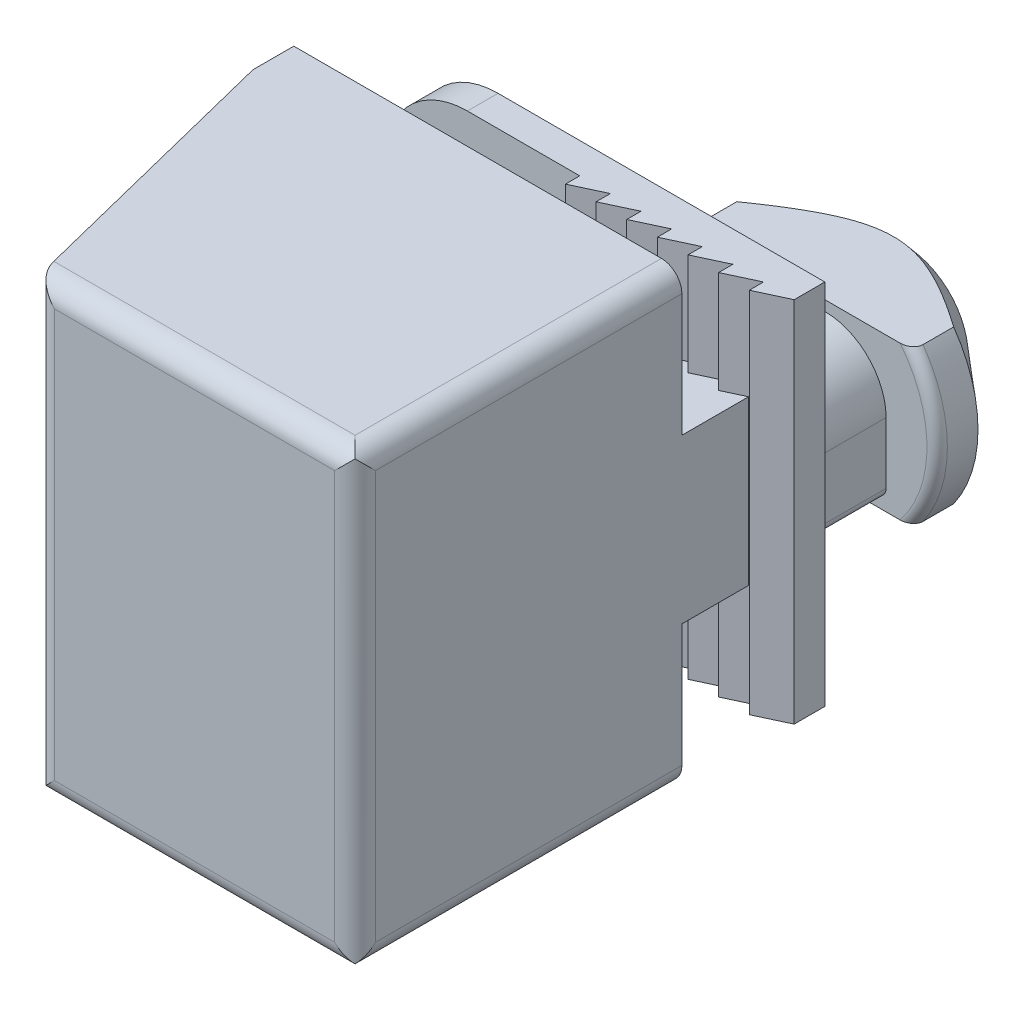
ISO-10303-21;
HEADER;
FILE_DESCRIPTION(('STEP AP214'),'2;1');
FILE_NAME('part.step','',(''),(''),'','','');
FILE_SCHEMA(('AUTOMOTIVE_DESIGN { 1 0 10303 214 1 1 1 1 }'));
ENDSEC;
DATA;
#1=APPLICATION_CONTEXT('core data for automotive mechanical design processes');
#2=APPLICATION_PROTOCOL_DEFINITION('international standard','automotive_design',2000,#1);
#3=PRODUCT_CONTEXT('',#1,'mechanical');
#4=PRODUCT('Part','Part','',(#3));
#5=PRODUCT_RELATED_PRODUCT_CATEGORY('part','',(#4));
#6=PRODUCT_DEFINITION_FORMATION('','',#4);
#7=PRODUCT_DEFINITION_CONTEXT('part definition',#1,'design');
#8=PRODUCT_DEFINITION('design','',#6,#7);
#9=PRODUCT_DEFINITION_SHAPE('','',#8);
#10=(LENGTH_UNIT() NAMED_UNIT(*) SI_UNIT(.MILLI.,.METRE.));
#11=(NAMED_UNIT(*) PLANE_ANGLE_UNIT() SI_UNIT($,.RADIAN.));
#12=(NAMED_UNIT(*) SI_UNIT($,.STERADIAN.) SOLID_ANGLE_UNIT());
#13=UNCERTAINTY_MEASURE_WITH_UNIT(LENGTH_MEASURE(1.E-05),#10,'distance_accuracy_value','');
#14=(GEOMETRIC_REPRESENTATION_CONTEXT(3) GLOBAL_UNCERTAINTY_ASSIGNED_CONTEXT((#13)) GLOBAL_UNIT_ASSIGNED_CONTEXT((#10,
#11,#12)) REPRESENTATION_CONTEXT('',''));
#15=CARTESIAN_POINT('',(0.,0.,0.));
#16=DIRECTION('',(0.,0.,1.));
#17=DIRECTION('',(1.,0.,0.));
#18=AXIS2_PLACEMENT_3D('',#15,#16,#17);
#19=CARTESIAN_POINT('',(0.,2.26032237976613,0.));
#20=DIRECTION('',(0.,0.,-1.));
#21=DIRECTION('',(-1.,0.,0.));
#22=AXIS2_PLACEMENT_3D('',#19,#20,#21);
#23=PLANE('',#22);
#24=CARTESIAN_POINT('',(0.,0.,0.));
#25=DIRECTION('',(0.,0.,1.));
#26=DIRECTION('',(0.,1.,0.));
#27=AXIS2_PLACEMENT_3D('',#24,#25,#26);
#28=CIRCLE('',#27,2.81503796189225);
#29=CARTESIAN_POINT('',(0.,2.81503796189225,0.));
#30=VERTEX_POINT('',#29);
#31=EDGE_CURVE('E573',#30,#30,#28,.T.);
#32=ORIENTED_EDGE('',*,*,#31,.F.);
#33=EDGE_LOOP('',(#32));
#34=FACE_BOUND('',#33,.T.);
#35=ADVANCED_FACE('F15',(#34),#23,.T.);
#36=CARTESIAN_POINT('',(0.,0.,0.500000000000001));
#37=DIRECTION('',(0.,0.,1.));
#38=DIRECTION('',(0.,1.,0.));
#39=AXIS2_PLACEMENT_3D('',#36,#37,#38);
#40=TOROIDAL_SURFACE('',#39,2.81503796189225,0.499999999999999);
#41=ORIENTED_EDGE('',*,*,#31,.T.);
#42=EDGE_LOOP('',(#41));
#43=FACE_BOUND('',#42,.T.);
#44=CARTESIAN_POINT('',(0.,0.,0.120371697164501));
#45=DIRECTION('',(0.,0.,1.));
#46=DIRECTION('',(0.,1.,0.));
#47=AXIS2_PLACEMENT_3D('',#44,#45,#46);
#48=CIRCLE('',#47,3.14043365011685);
#49=CARTESIAN_POINT('',(0.,3.14043365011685,0.120371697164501));
#50=VERTEX_POINT('',#49);
#51=EDGE_CURVE('E474',#50,#50,#48,.T.);
#52=ORIENTED_EDGE('',*,*,#51,.F.);
#53=EDGE_LOOP('',(#52));
#54=FACE_BOUND('',#53,.T.);
#55=ADVANCED_FACE('F577',(#43,#54),#40,.T.);
#56=CARTESIAN_POINT('',(-2.,9.,11.));
#57=DIRECTION('',(-1.,0.,0.));
#58=DIRECTION('',(0.,0.,1.));
#59=AXIS2_PLACEMENT_3D('',#56,#57,#58);
#60=PLANE('',#59);
#61=DIRECTION('',(0.,0.,1.));
#62=VECTOR('',#61,1.);
#63=CARTESIAN_POINT('',(-2.,-9.,11.));
#64=LINE('',#63,#62);
#65=CARTESIAN_POINT('',(-2.,-9.00000000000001,11.));
#66=VERTEX_POINT('',#65);
#67=CARTESIAN_POINT('',(-1.99999999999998,-9.00000000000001,11.7));
#68=VERTEX_POINT('',#67);
#69=EDGE_CURVE('E566',#66,#68,#64,.T.);
#70=ORIENTED_EDGE('',*,*,#69,.T.);
#71=DIRECTION('',(0.,1.,0.));
#72=VECTOR('',#71,1.);
#73=CARTESIAN_POINT('',(-1.99999999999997,9.,11.7));
#74=LINE('',#73,#72);
#75=CARTESIAN_POINT('',(-1.99999999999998,-4.00000000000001,11.7));
#76=VERTEX_POINT('',#75);
#77=EDGE_CURVE('E562',#76,#68,#74,.F.);
#78=ORIENTED_EDGE('',*,*,#77,.F.);
#79=DIRECTION('',(0.,0.,1.));
#80=VECTOR('',#79,1.);
#81=CARTESIAN_POINT('',(-2.,-4.,11.));
#82=LINE('',#81,#80);
#83=CARTESIAN_POINT('',(-2.,-4.00000000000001,11.));
#84=VERTEX_POINT('',#83);
#85=EDGE_CURVE('E570',#76,#84,#82,.F.);
#86=ORIENTED_EDGE('',*,*,#85,.T.);
#87=DIRECTION('',(0.,1.,0.));
#88=VECTOR('',#87,1.);
#89=CARTESIAN_POINT('',(-2.,9.,11.));
#90=LINE('',#89,#88);
#91=EDGE_CURVE('E527',#66,#84,#90,.T.);
#92=ORIENTED_EDGE('',*,*,#91,.F.);
#93=EDGE_LOOP('',(#70,#78,#86,#92));
#94=FACE_BOUND('',#93,.T.);
#95=ADVANCED_FACE('F581',(#94),#60,.T.);
#96=CARTESIAN_POINT('',(-2.,9.,11.7));
#97=DIRECTION('',(0.422885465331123,0.,0.906183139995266));
#98=DIRECTION('',(0.906183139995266,0.,-0.422885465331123));
#99=AXIS2_PLACEMENT_3D('',#96,#97,#98);
#100=PLANE('',#99);
#101=DIRECTION('',(0.906183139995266,0.,-0.422885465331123));
#102=VECTOR('',#101,1.);
#103=CARTESIAN_POINT('',(-2.,-9.00000000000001,11.7));
#104=LINE('',#103,#102);
#105=CARTESIAN_POINT('',(-0.499999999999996,-9.,11.));
#106=VERTEX_POINT('',#105);
#107=EDGE_CURVE('E558',#68,#106,#104,.T.);
#108=ORIENTED_EDGE('',*,*,#107,.T.);
#109=DIRECTION('',(0.,1.,0.));
#110=VECTOR('',#109,1.);
#111=CARTESIAN_POINT('',(-0.499999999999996,9.,11.));
#112=LINE('',#111,#110);
#113=CARTESIAN_POINT('',(-0.499999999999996,-4.,11.));
#114=VERTEX_POINT('',#113);
#115=EDGE_CURVE('E523',#114,#106,#112,.F.);
#116=ORIENTED_EDGE('',*,*,#115,.F.);
#117=DIRECTION('',(0.906183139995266,0.,-0.422885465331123));
#118=VECTOR('',#117,1.);
#119=CARTESIAN_POINT('',(-2.,-4.00000000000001,11.7));
#120=LINE('',#119,#118);
#121=EDGE_CURVE('E563',#114,#76,#120,.F.);
#122=ORIENTED_EDGE('',*,*,#121,.T.);
#123=ORIENTED_EDGE('',*,*,#77,.T.);
#124=EDGE_LOOP('',(#108,#116,#122,#123));
#125=FACE_BOUND('',#124,.T.);
#126=ADVANCED_FACE('F759',(#125),#100,.T.);
#127=CARTESIAN_POINT('',(-2.,9.,11.7));
#128=DIRECTION('',(0.422885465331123,0.,0.906183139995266));
#129=DIRECTION('',(0.906183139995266,0.,-0.422885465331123));
#130=AXIS2_PLACEMENT_3D('',#127,#128,#129);
#131=PLANE('',#130);
#132=DIRECTION('',(0.906183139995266,0.,-0.422885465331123));
#133=VECTOR('',#132,1.);
#134=CARTESIAN_POINT('',(-2.,9.,11.7));
#135=LINE('',#134,#133);
#136=CARTESIAN_POINT('',(-0.499999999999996,9.,11.));
#137=VERTEX_POINT('',#136);
#138=CARTESIAN_POINT('',(-2.,9.,11.7));
#139=VERTEX_POINT('',#138);
#140=EDGE_CURVE('E551',#137,#139,#135,.F.);
#141=ORIENTED_EDGE('',*,*,#140,.T.);
#142=DIRECTION('',(0.,1.,0.));
#143=VECTOR('',#142,1.);
#144=CARTESIAN_POINT('',(-2.,9.,11.7));
#145=LINE('',#144,#143);
#146=CARTESIAN_POINT('',(-2.,4.,11.7));
#147=VERTEX_POINT('',#146);
#148=EDGE_CURVE('E547',#147,#139,#145,.T.);
#149=ORIENTED_EDGE('',*,*,#148,.F.);
#150=DIRECTION('',(0.906183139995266,0.,-0.422885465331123));
#151=VECTOR('',#150,1.);
#152=CARTESIAN_POINT('',(-2.,4.,11.7));
#153=LINE('',#152,#151);
#154=CARTESIAN_POINT('',(-0.499999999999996,4.,11.));
#155=VERTEX_POINT('',#154);
#156=EDGE_CURVE('E555',#147,#155,#153,.T.);
#157=ORIENTED_EDGE('',*,*,#156,.T.);
#158=DIRECTION('',(0.,1.,0.));
#159=VECTOR('',#158,1.);
#160=CARTESIAN_POINT('',(-0.499999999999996,9.,11.));
#161=LINE('',#160,#159);
#162=EDGE_CURVE('E504',#137,#155,#161,.F.);
#163=ORIENTED_EDGE('',*,*,#162,.F.);
#164=EDGE_LOOP('',(#141,#149,#157,#163));
#165=FACE_BOUND('',#164,.T.);
#166=ADVANCED_FACE('F756',(#165),#131,.T.);
#167=CARTESIAN_POINT('',(-2.,9.,11.));
#168=DIRECTION('',(-1.,0.,0.));
#169=DIRECTION('',(0.,0.,1.));
#170=AXIS2_PLACEMENT_3D('',#167,#168,#169);
#171=PLANE('',#170);
#172=DIRECTION('',(0.,0.,1.));
#173=VECTOR('',#172,1.);
#174=CARTESIAN_POINT('',(-2.,9.,11.));
#175=LINE('',#174,#173);
#176=CARTESIAN_POINT('',(-1.99999999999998,9.,11.));
#177=VERTEX_POINT('',#176);
#178=EDGE_CURVE('E544',#139,#177,#175,.F.);
#179=ORIENTED_EDGE('',*,*,#178,.T.);
#180=DIRECTION('',(0.,1.,0.));
#181=VECTOR('',#180,1.);
#182=CARTESIAN_POINT('',(-1.99999999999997,9.,11.));
#183=LINE('',#182,#181);
#184=CARTESIAN_POINT('',(-1.99999999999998,4.,11.));
#185=VERTEX_POINT('',#184);
#186=EDGE_CURVE('E490',#185,#177,#183,.T.);
#187=ORIENTED_EDGE('',*,*,#186,.F.);
#188=DIRECTION('',(0.,0.,1.));
#189=VECTOR('',#188,1.);
#190=CARTESIAN_POINT('',(-2.,4.,11.));
#191=LINE('',#190,#189);
#192=EDGE_CURVE('E548',#185,#147,#191,.T.);
#193=ORIENTED_EDGE('',*,*,#192,.T.);
#194=ORIENTED_EDGE('',*,*,#148,.T.);
#195=EDGE_LOOP('',(#179,#187,#193,#194));
#196=FACE_BOUND('',#195,.T.);
#197=ADVANCED_FACE('F753',(#196),#171,.T.);
#198=CARTESIAN_POINT('',(0.,0.,3.75));
#199=DIRECTION('',(0.,0.,1.));
#200=DIRECTION('',(1.,0.,0.));
#201=AXIS2_PLACEMENT_3D('',#198,#199,#200);
#202=CYLINDRICAL_SURFACE('',#201,6.49999999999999);
#203=DIRECTION('',(0.,0.,1.));
#204=VECTOR('',#203,1.);
#205=CARTESIAN_POINT('',(-5.30919014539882,-3.75,3.75));
#206=LINE('',#205,#204);
#207=CARTESIAN_POINT('',(-5.30919014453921,-3.75,3.00000000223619));
#208=VERTEX_POINT('',#207);
#209=CARTESIAN_POINT('',(-5.30919014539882,-3.75,4.5));
#210=VERTEX_POINT('',#209);
#211=EDGE_CURVE('E475',#208,#210,#206,.T.);
#212=ORIENTED_EDGE('',*,*,#211,.T.);
#213=CARTESIAN_POINT('',(0.,0.,4.5));
#214=DIRECTION('',(0.,0.,1.));
#215=DIRECTION('',(0.,1.,0.));
#216=AXIS2_PLACEMENT_3D('',#213,#214,#215);
#217=CIRCLE('',#216,6.5);
#218=CARTESIAN_POINT('',(-5.30919014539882,3.75,4.5));
#219=VERTEX_POINT('',#218);
#220=EDGE_CURVE('E481',#219,#210,#217,.T.);
#221=ORIENTED_EDGE('',*,*,#220,.F.);
#222=DIRECTION('',(0.,0.,1.));
#223=VECTOR('',#222,1.);
#224=CARTESIAN_POINT('',(-5.30919014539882,3.75,5.));
#225=LINE('',#224,#223);
#226=CARTESIAN_POINT('',(-5.30919014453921,3.75,3.00000000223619));
#227=VERTEX_POINT('',#226);
#228=EDGE_CURVE('E478',#227,#219,#225,.T.);
#229=ORIENTED_EDGE('',*,*,#228,.F.);
#230=CARTESIAN_POINT('',(0.,0.,3.00000000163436));
#231=DIRECTION('',(0.,0.,1.));
#232=DIRECTION('',(0.,1.,0.));
#233=AXIS2_PLACEMENT_3D('',#230,#231,#232);
#234=CIRCLE('',#233,6.49999999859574);
#235=EDGE_CURVE('E468',#208,#227,#234,.F.);
#236=ORIENTED_EDGE('',*,*,#235,.F.);
#237=EDGE_LOOP('',(#212,#221,#229,#236));
#238=FACE_BOUND('',#237,.T.);
#239=ADVANCED_FACE('F479',(#238),#202,.T.);
#240=CARTESIAN_POINT('',(0.,0.,3.00000000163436));
#241=DIRECTION('',(0.,0.,1.));
#242=DIRECTION('',(1.,0.,0.));
#243=AXIS2_PLACEMENT_3D('',#240,#241,#242);
#244=CONICAL_SURFACE('',#243,6.49999999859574,0.862170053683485);
#245=ORIENTED_EDGE('',*,*,#51,.T.);
#246=EDGE_LOOP('',(#245));
#247=FACE_BOUND('',#246,.T.);
#248=CARTESIAN_POINT('',(-5.30919014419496,-3.7500000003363,3.00000000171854));
#249=CARTESIAN_POINT('',(-5.20102064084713,-3.75000000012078,2.9242779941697));
#250=CARTESIAN_POINT('',(-5.09249512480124,-3.75000000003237,2.84905991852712));
#251=CARTESIAN_POINT('',(-4.87460923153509,-3.74999999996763,2.69982502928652));
#252=CARTESIAN_POINT('',(-4.76524878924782,-3.74999999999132,2.62580831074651));
#253=CARTESIAN_POINT('',(-4.5453579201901,-3.7500000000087,2.47902847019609));
#254=CARTESIAN_POINT('',(-4.43482552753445,-3.75000000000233,2.4062682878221));
#255=CARTESIAN_POINT('',(-4.21267873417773,-3.74999999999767,2.26242116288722));
#256=CARTESIAN_POINT('',(-4.10106435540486,-3.74999999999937,2.19133418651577));
#257=CARTESIAN_POINT('',(-3.87295268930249,-3.75000000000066,2.04887841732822));
#258=CARTESIAN_POINT('',(-3.75641437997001,-3.75000000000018,1.9775751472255));
#259=CARTESIAN_POINT('',(-3.52180870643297,-3.74999999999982,1.83753204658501));
#260=CARTESIAN_POINT('',(-3.40374139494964,-3.74999999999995,1.76879212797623));
#261=CARTESIAN_POINT('',(-3.16592564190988,-3.75000000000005,1.63447874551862));
#262=CARTESIAN_POINT('',(-3.04617848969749,-3.75000000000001,1.56890300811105));
#263=CARTESIAN_POINT('',(-2.80467069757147,-3.74999999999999,1.44157609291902));
#264=CARTESIAN_POINT('',(-2.68291019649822,-3.75,1.3798246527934));
#265=CARTESIAN_POINT('',(-2.41828227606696,-3.75,1.25193561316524));
#266=CARTESIAN_POINT('',(-2.2750366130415,-3.75,1.18657321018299));
#267=CARTESIAN_POINT('',(-1.98510577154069,-3.75,1.06383364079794));
#268=CARTESIAN_POINT('',(-1.83842017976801,-3.75,1.00645743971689));
#269=CARTESIAN_POINT('',(-1.54265808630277,-3.75,0.90230383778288));
#270=CARTESIAN_POINT('',(-1.39361171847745,-3.75,0.855442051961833));
#271=CARTESIAN_POINT('',(-1.09217826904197,-3.75,0.774168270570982));
#272=CARTESIAN_POINT('',(-0.939793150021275,-3.75,0.739749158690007));
#273=CARTESIAN_POINT('',(-0.65780127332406,-3.75,0.690158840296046));
#274=CARTESIAN_POINT('',(-0.528591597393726,-3.75,0.672746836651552));
#275=CARTESIAN_POINT('',(-0.269145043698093,-3.75,0.649229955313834));
#276=CARTESIAN_POINT('',(-0.138908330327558,-3.75,0.643123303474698));
#277=CARTESIAN_POINT('',(0.121576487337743,-3.75,0.642608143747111));
#278=CARTESIAN_POINT('',(0.251824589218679,-3.75,0.648198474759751));
#279=CARTESIAN_POINT('',(0.511333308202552,-3.75,0.670710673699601));
#280=CARTESIAN_POINT('',(0.640593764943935,-3.75,0.68763434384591));
#281=CARTESIAN_POINT('',(0.943623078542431,-3.75,0.739814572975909));
#282=CARTESIAN_POINT('',(1.11663175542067,-3.75,0.779481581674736));
#283=CARTESIAN_POINT('',(1.45826220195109,-3.75,0.874543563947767));
#284=CARTESIAN_POINT('',(1.62688093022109,-3.75,0.929949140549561));
#285=CARTESIAN_POINT('',(1.96124123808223,-3.75,1.0535836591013));
#286=CARTESIAN_POINT('',(2.12693562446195,-3.75,1.12193819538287));
#287=CARTESIAN_POINT('',(2.45401194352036,-3.75,1.26807535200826));
#288=CARTESIAN_POINT('',(2.61539473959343,-3.75,1.34585606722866));
#289=CARTESIAN_POINT('',(3.00007645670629,-3.75,1.54197333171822));
#290=CARTESIAN_POINT('',(3.22156346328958,-3.75,1.66384002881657));
#291=CARTESIAN_POINT('',(3.65895736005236,-3.75,1.91729789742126));
#292=CARTESIAN_POINT('',(3.87486145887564,-3.75,2.04889381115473));
#293=CARTESIAN_POINT('',(4.29565002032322,-3.75,2.31470280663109));
#294=CARTESIAN_POINT('',(4.50066801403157,-3.75,2.4487056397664));
#295=CARTESIAN_POINT('',(4.80568236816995,-3.75,2.65314376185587));
#296=CARTESIAN_POINT('',(4.90686965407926,-3.75,2.72181605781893));
#297=CARTESIAN_POINT('',(5.10853665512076,-3.75,2.86017977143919));
#298=CARTESIAN_POINT('',(5.20901641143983,-3.75,2.92987112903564));
#299=CARTESIAN_POINT('',(5.30919014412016,-3.75,3.00000000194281));
#300=B_SPLINE_CURVE_WITH_KNOTS('',3,(#248,#249,#250,#251,#252,#253,#254,#255,#256,#257,#258,
#259,#260,#261,#262,#263,#264,#265,#266,#267,#268,#269,#270,#271,#272,#273,#274,#275,#276,#277,
#278,#279,#280,#281,#282,#283,#284,#285,#286,#287,#288,#289,#290,#291,#292,#293,#294,#295,#296,
#297,#298,#299),.UNSPECIFIED.,.F.,.F.,(4,2,2,2,2,2,2,2,2,2,2,2,2,2,2,2,2,2,2,2,2,2,2,2,2,4),(0.,
0.3961214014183,0.792273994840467,1.18925361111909,1.5862251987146,1.99606135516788,
2.40588341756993,2.81540648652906,3.22490143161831,3.69706996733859,4.16929552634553,
4.63758361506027,5.10560345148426,5.49628403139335,5.88690329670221,6.27748378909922,
6.66812640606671,7.1996497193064,7.73153197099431,8.26886491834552,8.8060894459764,
9.56410185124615,10.3224861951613,11.0571744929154,11.4240388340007,11.7908816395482),.UNSPECIFIED.);
#301=CARTESIAN_POINT('',(5.30919014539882,-3.75,3.000000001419));
#302=VERTEX_POINT('',#301);
#303=EDGE_CURVE('E472',#208,#302,#300,.T.);
#304=ORIENTED_EDGE('',*,*,#303,.F.);
#305=ORIENTED_EDGE('',*,*,#235,.T.);
#306=CARTESIAN_POINT('',(5.30919014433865,3.75000000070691,3.00000000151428));
#307=CARTESIAN_POINT('',(5.20102064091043,3.7500000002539,2.92427799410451));
#308=CARTESIAN_POINT('',(5.09249512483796,3.75000000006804,2.84905991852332));
#309=CARTESIAN_POINT('',(4.87460923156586,3.74999999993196,2.69982502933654));
#310=CARTESIAN_POINT('',(4.76524878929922,3.74999999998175,2.62580831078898));
#311=CARTESIAN_POINT('',(4.54535792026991,3.75000000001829,2.47902847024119));
#312=CARTESIAN_POINT('',(4.43482552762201,3.75000000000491,2.40626828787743));
#313=CARTESIAN_POINT('',(4.21267873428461,3.74999999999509,2.2624211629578));
#314=CARTESIAN_POINT('',(4.10106435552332,3.74999999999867,2.19133418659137));
#315=CARTESIAN_POINT('',(3.87295268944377,3.75000000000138,2.04887841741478));
#316=CARTESIAN_POINT('',(3.75641438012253,3.75000000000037,1.97757514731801));
#317=CARTESIAN_POINT('',(3.52180870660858,3.74999999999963,1.83753204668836));
#318=CARTESIAN_POINT('',(3.4037413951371,3.7499999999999,1.76879212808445));
#319=CARTESIAN_POINT('',(3.16592564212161,3.7500000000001,1.63447874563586));
#320=CARTESIAN_POINT('',(3.04617848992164,3.75000000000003,1.56890300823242));
#321=CARTESIAN_POINT('',(2.80467069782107,3.74999999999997,1.44157609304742));
#322=CARTESIAN_POINT('',(2.68291019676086,3.74999999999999,1.37982465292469));
#323=CARTESIAN_POINT('',(2.41828227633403,3.75000000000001,1.25193561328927));
#324=CARTESIAN_POINT('',(2.27503661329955,3.75,1.18657321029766));
#325=CARTESIAN_POINT('',(1.9851057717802,3.75,1.06383364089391));
#326=CARTESIAN_POINT('',(1.838420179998,3.75,1.00645743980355));
#327=CARTESIAN_POINT('',(1.54265808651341,3.75,0.902303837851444));
#328=CARTESIAN_POINT('',(1.39361171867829,3.75,0.855442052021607));
#329=CARTESIAN_POINT('',(1.09217826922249,3.75,0.774168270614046));
#330=CARTESIAN_POINT('',(0.939793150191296,3.75,0.739749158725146));
#331=CARTESIAN_POINT('',(0.657801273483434,3.75,0.690158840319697));
#332=CARTESIAN_POINT('',(0.528591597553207,3.75,0.672746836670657));
#333=CARTESIAN_POINT('',(0.269145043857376,3.75,0.649229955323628));
#334=CARTESIAN_POINT('',(0.138908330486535,3.75,0.64312330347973));
#335=CARTESIAN_POINT('',(-0.121576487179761,3.75,0.642608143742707));
#336=CARTESIAN_POINT('',(-0.251824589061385,3.75,0.64819847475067));
#337=CARTESIAN_POINT('',(-0.511333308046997,3.75,0.670710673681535));
#338=CARTESIAN_POINT('',(-0.640593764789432,3.75,0.687634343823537));
#339=CARTESIAN_POINT('',(-0.94362307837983,3.75,0.739814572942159));
#340=CARTESIAN_POINT('',(-1.11663175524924,3.75,0.779481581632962));
#341=CARTESIAN_POINT('',(-1.45826220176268,3.75,0.874543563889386));
#342=CARTESIAN_POINT('',(-1.62688093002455,3.75,0.929949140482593));
#343=CARTESIAN_POINT('',(-1.96124123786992,3.75,1.05358365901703));
#344=CARTESIAN_POINT('',(-2.126935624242,3.75,1.12193819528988));
#345=CARTESIAN_POINT('',(-2.45401194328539,3.75,1.26807535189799));
#346=CARTESIAN_POINT('',(-2.61539473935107,3.75,1.34585606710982));
#347=CARTESIAN_POINT('',(-3.00007645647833,3.75,1.54197333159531));
#348=CARTESIAN_POINT('',(-3.22156346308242,3.75,1.66384002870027));
#349=CARTESIAN_POINT('',(-3.65895735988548,3.75,1.91729789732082));
#350=CARTESIAN_POINT('',(-3.87486145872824,3.75,2.04889381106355));
#351=CARTESIAN_POINT('',(-4.29565002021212,3.75,2.31470280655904));
#352=CARTESIAN_POINT('',(-4.50066801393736,3.75,2.44870563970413));
#353=CARTESIAN_POINT('',(-4.80568236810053,3.75,2.65314376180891));
#354=CARTESIAN_POINT('',(-4.90686965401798,3.75,2.72181605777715));
#355=CARTESIAN_POINT('',(-5.10853665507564,3.75,2.86017977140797));
#356=CARTESIAN_POINT('',(-5.20901641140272,3.75,2.92987112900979));
#357=CARTESIAN_POINT('',(-5.30919014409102,3.75,3.0000000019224));
#358=B_SPLINE_CURVE_WITH_KNOTS('',3,(#306,#307,#308,#309,#310,#311,#312,#313,#314,#315,#316,
#317,#318,#319,#320,#321,#322,#323,#324,#325,#326,#327,#328,#329,#330,#331,#332,#333,#334,#335,
#336,#337,#338,#339,#340,#341,#342,#343,#344,#345,#346,#347,#348,#349,#350,#351,#352,#353,#354,
#355,#356,#357),.UNSPECIFIED.,.F.,.F.,(4,2,2,2,2,2,2,2,2,2,2,2,2,2,2,2,2,2,2,2,2,2,2,2,2,4),(0.,
0.396121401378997,0.79227399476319,1.18925361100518,1.58622519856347,1.99606135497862,
2.40588341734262,2.81540648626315,3.22490143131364,3.6970699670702,4.16929552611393,
4.63758361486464,5.10560345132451,5.49628403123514,5.88690329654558,6.27748378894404,
6.66812640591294,7.19964971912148,7.73153197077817,8.26886491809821,8.80608944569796,
9.56410185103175,10.3224861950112,11.0571744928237,11.4240388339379,11.7908816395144),.UNSPECIFIED.);
#359=CARTESIAN_POINT('',(5.30919014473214,3.75,3.00000000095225));
#360=VERTEX_POINT('',#359);
#361=EDGE_CURVE('E19',#360,#227,#358,.T.);
#362=ORIENTED_EDGE('',*,*,#361,.F.);
#363=CARTESIAN_POINT('',(0.,0.,3.));
#364=DIRECTION('',(0.,0.,1.));
#365=DIRECTION('',(1.,0.,0.));
#366=AXIS2_PLACEMENT_3D('',#363,#364,#365);
#367=CIRCLE('',#366,6.49999999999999);
#368=EDGE_CURVE('E538',#302,#360,#367,.T.);
#369=ORIENTED_EDGE('',*,*,#368,.F.);
#370=EDGE_LOOP('',(#304,#305,#362,#369));
#371=FACE_BOUND('',#370,.T.);
#372=ADVANCED_FACE('F470',(#247,#371),#244,.T.);
#373=CARTESIAN_POINT('',(0.,0.,3.75));
#374=DIRECTION('',(0.,0.,1.));
#375=DIRECTION('',(1.,0.,0.));
#376=AXIS2_PLACEMENT_3D('',#373,#374,#375);
#377=CYLINDRICAL_SURFACE('',#376,6.49999999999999);
#378=DIRECTION('',(0.,0.,-1.));
#379=VECTOR('',#378,1.);
#380=CARTESIAN_POINT('',(5.30919014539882,-3.75,5.));
#381=LINE('',#380,#379);
#382=CARTESIAN_POINT('',(5.30919014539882,-3.75,4.5));
#383=VERTEX_POINT('',#382);
#384=EDGE_CURVE('E741',#302,#383,#381,.F.);
#385=ORIENTED_EDGE('',*,*,#384,.F.);
#386=ORIENTED_EDGE('',*,*,#368,.T.);
#387=DIRECTION('',(0.,0.,1.));
#388=VECTOR('',#387,1.);
#389=CARTESIAN_POINT('',(5.30919014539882,3.75,5.));
#390=LINE('',#389,#388);
#391=CARTESIAN_POINT('',(5.30919014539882,3.75,4.5));
#392=VERTEX_POINT('',#391);
#393=EDGE_CURVE('E484',#392,#360,#390,.F.);
#394=ORIENTED_EDGE('',*,*,#393,.F.);
#395=CARTESIAN_POINT('',(0.,0.,4.5));
#396=DIRECTION('',(0.,0.,1.));
#397=DIRECTION('',(0.,1.,0.));
#398=AXIS2_PLACEMENT_3D('',#395,#396,#397);
#399=CIRCLE('',#398,6.5);
#400=EDGE_CURVE('E706',#383,#392,#399,.T.);
#401=ORIENTED_EDGE('',*,*,#400,.F.);
#402=EDGE_LOOP('',(#385,#386,#394,#401));
#403=FACE_BOUND('',#402,.T.);
#404=ADVANCED_FACE('F747',(#403),#377,.T.);
#405=CARTESIAN_POINT('',(-3.5,9.,11.7));
#406=DIRECTION('',(0.422885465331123,0.,0.906183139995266));
#407=DIRECTION('',(0.906183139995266,0.,-0.422885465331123));
#408=AXIS2_PLACEMENT_3D('',#405,#406,#407);
#409=PLANE('',#408);
#410=DIRECTION('',(0.906183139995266,0.,-0.422885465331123));
#411=VECTOR('',#410,1.);
#412=CARTESIAN_POINT('',(-3.5,-9.00000000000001,11.7));
#413=LINE('',#412,#411);
#414=CARTESIAN_POINT('',(-3.5,-9.,11.7));
#415=VERTEX_POINT('',#414);
#416=EDGE_CURVE('E532',#415,#66,#413,.T.);
#417=ORIENTED_EDGE('',*,*,#416,.T.);
#418=ORIENTED_EDGE('',*,*,#91,.T.);
#419=DIRECTION('',(0.906183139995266,0.,-0.422885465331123));
#420=VECTOR('',#419,1.);
#421=CARTESIAN_POINT('',(-3.5,-4.00000000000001,11.7));
#422=LINE('',#421,#420);
#423=CARTESIAN_POINT('',(-3.5,-4.,11.7));
#424=VERTEX_POINT('',#423);
#425=EDGE_CURVE('E535',#84,#424,#422,.F.);
#426=ORIENTED_EDGE('',*,*,#425,.T.);
#427=DIRECTION('',(0.,1.,0.));
#428=VECTOR('',#427,1.);
#429=CARTESIAN_POINT('',(-3.5,9.,11.7));
#430=LINE('',#429,#428);
#431=EDGE_CURVE('E528',#415,#424,#430,.T.);
#432=ORIENTED_EDGE('',*,*,#431,.F.);
#433=EDGE_LOOP('',(#417,#418,#426,#432));
#434=FACE_BOUND('',#433,.T.);
#435=ADVANCED_FACE('F1125',(#434),#409,.T.);
#436=CARTESIAN_POINT('',(-0.499999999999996,9.,11.));
#437=DIRECTION('',(-1.,0.,0.));
#438=DIRECTION('',(0.,0.,1.));
#439=AXIS2_PLACEMENT_3D('',#436,#437,#438);
#440=PLANE('',#439);
#441=DIRECTION('',(0.,0.,1.));
#442=VECTOR('',#441,1.);
#443=CARTESIAN_POINT('',(-0.499999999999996,-9.,11.));
#444=LINE('',#443,#442);
#445=CARTESIAN_POINT('',(-0.499999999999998,-9.00000000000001,11.7));
#446=VERTEX_POINT('',#445);
#447=EDGE_CURVE('E516',#106,#446,#444,.T.);
#448=ORIENTED_EDGE('',*,*,#447,.T.);
#449=DIRECTION('',(0.,1.,0.));
#450=VECTOR('',#449,1.);
#451=CARTESIAN_POINT('',(-0.499999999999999,9.,11.7));
#452=LINE('',#451,#450);
#453=CARTESIAN_POINT('',(-0.499999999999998,-4.00000000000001,11.7));
#454=VERTEX_POINT('',#453);
#455=EDGE_CURVE('E517',#454,#446,#452,.F.);
#456=ORIENTED_EDGE('',*,*,#455,.F.);
#457=DIRECTION('',(0.,0.,1.));
#458=VECTOR('',#457,1.);
#459=CARTESIAN_POINT('',(-0.499999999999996,-4.,11.));
#460=LINE('',#459,#458);
#461=EDGE_CURVE('E524',#454,#114,#460,.F.);
#462=ORIENTED_EDGE('',*,*,#461,.T.);
#463=ORIENTED_EDGE('',*,*,#115,.T.);
#464=EDGE_LOOP('',(#448,#456,#462,#463));
#465=FACE_BOUND('',#464,.T.);
#466=ADVANCED_FACE('F1122',(#465),#440,.T.);
#467=CARTESIAN_POINT('',(-0.499999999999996,9.,11.));
#468=DIRECTION('',(-1.,0.,0.));
#469=DIRECTION('',(0.,0.,1.));
#470=AXIS2_PLACEMENT_3D('',#467,#468,#469);
#471=PLANE('',#470);
#472=DIRECTION('',(0.,0.,1.));
#473=VECTOR('',#472,1.);
#474=CARTESIAN_POINT('',(-0.499999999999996,9.,11.));
#475=LINE('',#474,#473);
#476=CARTESIAN_POINT('',(-0.499999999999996,9.,11.7));
#477=VERTEX_POINT('',#476);
#478=EDGE_CURVE('E510',#477,#137,#475,.F.);
#479=ORIENTED_EDGE('',*,*,#478,.T.);
#480=ORIENTED_EDGE('',*,*,#162,.T.);
#481=DIRECTION('',(0.,0.,1.));
#482=VECTOR('',#481,1.);
#483=CARTESIAN_POINT('',(-0.499999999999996,4.,11.));
#484=LINE('',#483,#482);
#485=CARTESIAN_POINT('',(-0.499999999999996,4.,11.7));
#486=VERTEX_POINT('',#485);
#487=EDGE_CURVE('E513',#155,#486,#484,.T.);
#488=ORIENTED_EDGE('',*,*,#487,.T.);
#489=DIRECTION('',(0.,1.,0.));
#490=VECTOR('',#489,1.);
#491=CARTESIAN_POINT('',(-0.499999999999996,9.,11.7));
#492=LINE('',#491,#490);
#493=EDGE_CURVE('E505',#477,#486,#492,.F.);
#494=ORIENTED_EDGE('',*,*,#493,.F.);
#495=EDGE_LOOP('',(#479,#480,#488,#494));
#496=FACE_BOUND('',#495,.T.);
#497=ADVANCED_FACE('F1119',(#496),#471,.T.);
#498=CARTESIAN_POINT('',(-3.5,9.,11.7));
#499=DIRECTION('',(0.422885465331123,0.,0.906183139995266));
#500=DIRECTION('',(0.906183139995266,0.,-0.422885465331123));
#501=AXIS2_PLACEMENT_3D('',#498,#499,#500);
#502=PLANE('',#501);
#503=DIRECTION('',(0.906183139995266,0.,-0.422885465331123));
#504=VECTOR('',#503,1.);
#505=CARTESIAN_POINT('',(-3.5,9.,11.7));
#506=LINE('',#505,#504);
#507=CARTESIAN_POINT('',(-3.5,9.,11.7));
#508=VERTEX_POINT('',#507);
#509=EDGE_CURVE('E489',#177,#508,#506,.F.);
#510=ORIENTED_EDGE('',*,*,#509,.T.);
#511=DIRECTION('',(0.,1.,0.));
#512=VECTOR('',#511,1.);
#513=CARTESIAN_POINT('',(-3.5,9.,11.7));
#514=LINE('',#513,#512);
#515=CARTESIAN_POINT('',(-3.5,4.,11.7));
#516=VERTEX_POINT('',#515);
#517=EDGE_CURVE('E501',#516,#508,#514,.T.);
#518=ORIENTED_EDGE('',*,*,#517,.F.);
#519=DIRECTION('',(0.906183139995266,0.,-0.422885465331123));
#520=VECTOR('',#519,1.);
#521=CARTESIAN_POINT('',(-3.5,4.,11.7));
#522=LINE('',#521,#520);
#523=EDGE_CURVE('E497',#516,#185,#522,.T.);
#524=ORIENTED_EDGE('',*,*,#523,.T.);
#525=ORIENTED_EDGE('',*,*,#186,.T.);
#526=EDGE_LOOP('',(#510,#518,#524,#525));
#527=FACE_BOUND('',#526,.T.);
#528=ADVANCED_FACE('F1110',(#527),#502,.T.);
#529=CARTESIAN_POINT('',(0.,3.75,5.));
#530=DIRECTION('',(0.,1.,0.));
#531=DIRECTION('',(0.,0.,1.));
#532=AXIS2_PLACEMENT_3D('',#529,#530,#531);
#533=PLANE('',#532);
#534=CARTESIAN_POINT('',(5.30919014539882,3.75,4.5));
#535=CARTESIAN_POINT('',(5.30923162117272,3.75,4.52439826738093));
#536=CARTESIAN_POINT('',(5.30700683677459,3.75,4.54876223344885));
#537=CARTESIAN_POINT('',(5.29836577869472,3.75,4.59660709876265));
#538=CARTESIAN_POINT('',(5.29197181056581,3.75,4.6200919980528));
#539=CARTESIAN_POINT('',(5.27533725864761,3.75,4.66560968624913));
#540=CARTESIAN_POINT('',(5.2651014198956,3.75,4.68764422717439));
#541=CARTESIAN_POINT('',(5.24128514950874,3.75,4.72983732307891));
#542=CARTESIAN_POINT('',(5.22770109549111,3.75,4.7499938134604));
#543=CARTESIAN_POINT('',(5.19682194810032,3.75,4.7892595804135));
#544=CARTESIAN_POINT('',(5.1793509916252,3.75,4.80822991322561));
#545=CARTESIAN_POINT('',(5.14188107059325,3.75,4.84351113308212));
#546=CARTESIAN_POINT('',(5.12187779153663,3.75,4.85981736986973));
#547=CARTESIAN_POINT('',(5.0517971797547,3.75,4.90968137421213));
#548=CARTESIAN_POINT('',(4.99729779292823,3.75,4.93712248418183));
#549=CARTESIAN_POINT('',(4.87190727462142,3.75,4.98135223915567));
#550=CARTESIAN_POINT('',(4.7999162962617,3.75,4.99491865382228));
#551=CARTESIAN_POINT('',(4.71307295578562,3.75,4.99960677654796));
#552=CARTESIAN_POINT('',(4.6984002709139,3.75,4.99999926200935));
#553=CARTESIAN_POINT('',(4.68374849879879,3.75,5.));
#554=B_SPLINE_CURVE_WITH_KNOTS('',3,(#534,#535,#536,#537,#538,#539,#540,#541,#542,#543,#544,
#545,#546,#547,#548,#549,#550,#551,#552,#553),.UNSPECIFIED.,.F.,.F.,(4,2,2,2,2,2,2,2,2,4),(0.,
0.0730394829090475,0.14569136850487,0.218253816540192,0.290895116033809,0.367968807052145,
0.445175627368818,0.625705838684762,0.842292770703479,0.886298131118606),.UNSPECIFIED.);
#555=CARTESIAN_POINT('',(4.68374849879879,3.75,5.));
#556=VERTEX_POINT('',#555);
#557=EDGE_CURVE('E707',#392,#556,#554,.T.);
#558=ORIENTED_EDGE('',*,*,#557,.F.);
#559=ORIENTED_EDGE('',*,*,#393,.T.);
#560=ORIENTED_EDGE('',*,*,#361,.T.);
#561=ORIENTED_EDGE('',*,*,#228,.T.);
#562=CARTESIAN_POINT('',(-4.68374849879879,3.75,5.));
#563=CARTESIAN_POINT('',(-4.70488198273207,3.75,4.99999863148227));
#564=CARTESIAN_POINT('',(-4.72601855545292,3.75,4.99918333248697));
#565=CARTESIAN_POINT('',(-4.76814287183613,3.75,4.99589052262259));
#566=CARTESIAN_POINT('',(-4.78913072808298,3.75,4.99341444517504));
#567=CARTESIAN_POINT('',(-4.83097753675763,3.75,4.98674384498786));
#568=CARTESIAN_POINT('',(-4.85183471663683,3.75,4.98253805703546));
#569=CARTESIAN_POINT('',(-4.89314409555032,3.75,4.97235961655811));
#570=CARTESIAN_POINT('',(-4.91359563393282,3.75,4.96638429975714));
#571=CARTESIAN_POINT('',(-4.96692806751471,3.75,4.94816853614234));
#572=CARTESIAN_POINT('',(-4.99929804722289,3.75,4.93437498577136));
#573=CARTESIAN_POINT('',(-5.06134277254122,3.75,4.90173266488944));
#574=CARTESIAN_POINT('',(-5.09102236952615,3.75,4.88289324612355));
#575=CARTESIAN_POINT('',(-5.14144914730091,3.75,4.84402815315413));
#576=CARTESIAN_POINT('',(-5.16283950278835,3.75,4.8248399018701));
#577=CARTESIAN_POINT('',(-5.20221028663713,3.75,4.78318905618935));
#578=CARTESIAN_POINT('',(-5.22018990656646,3.75,4.76072568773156));
#579=CARTESIAN_POINT('',(-5.2519542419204,3.75,4.71270550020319));
#580=CARTESIAN_POINT('',(-5.265702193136,3.75,4.6871241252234));
#581=CARTESIAN_POINT('',(-5.28786741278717,3.75,4.63376516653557));
#582=CARTESIAN_POINT('',(-5.29629720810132,3.75,4.60599291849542));
#583=CARTESIAN_POINT('',(-5.30422194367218,3.75,4.56488761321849));
#584=CARTESIAN_POINT('',(-5.30608176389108,3.75,4.55197772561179));
#585=CARTESIAN_POINT('',(-5.30856583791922,3.75,4.52604829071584));
#586=CARTESIAN_POINT('',(-5.30919089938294,3.75,4.51302882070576));
#587=CARTESIAN_POINT('',(-5.30919014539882,3.75,4.5));
#588=B_SPLINE_CURVE_WITH_KNOTS('',3,(#562,#563,#564,#565,#566,#567,#568,#569,#570,#571,#572,
#573,#574,#575,#576,#577,#578,#579,#580,#581,#582,#583,#584,#585,#586,#587),.UNSPECIFIED.,.F.,
.F.,(4,2,2,2,2,2,2,2,2,2,2,2,4),(0.,0.0633891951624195,0.126723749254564,0.190477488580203,
0.254327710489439,0.359450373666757,0.464379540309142,0.550244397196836,0.636129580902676,
0.722741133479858,0.809147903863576,0.84822684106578,0.887280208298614),.UNSPECIFIED.);
#589=CARTESIAN_POINT('',(-4.68374849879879,3.75,5.));
#590=VERTEX_POINT('',#589);
#591=EDGE_CURVE('E742',#590,#219,#588,.T.);
#592=ORIENTED_EDGE('',*,*,#591,.F.);
#593=DIRECTION('',(1.,0.,0.));
#594=VECTOR('',#593,1.);
#595=CARTESIAN_POINT('',(0.,3.75,5.));
#596=LINE('',#595,#594);
#597=EDGE_CURVE('E701',#556,#590,#596,.F.);
#598=ORIENTED_EDGE('',*,*,#597,.F.);
#599=EDGE_LOOP('',(#558,#559,#560,#561,#592,#598));
#600=FACE_BOUND('',#599,.T.);
#601=ADVANCED_FACE('F488',(#600),#533,.T.);
#602=CARTESIAN_POINT('',(0.,0.,4.5));
#603=DIRECTION('',(0.,0.,1.));
#604=DIRECTION('',(0.,1.,0.));
#605=AXIS2_PLACEMENT_3D('',#602,#603,#604);
#606=TOROIDAL_SURFACE('',#605,5.99999999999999,0.500000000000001);
#607=CARTESIAN_POINT('',(-4.68374849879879,-3.75,5.));
#608=CARTESIAN_POINT('',(-4.70488198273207,-3.75,4.99999863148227));
#609=CARTESIAN_POINT('',(-4.72601855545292,-3.75,4.99918333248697));
#610=CARTESIAN_POINT('',(-4.76814287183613,-3.75,4.99589052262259));
#611=CARTESIAN_POINT('',(-4.78913072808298,-3.75,4.99341444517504));
#612=CARTESIAN_POINT('',(-4.83097753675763,-3.75,4.98674384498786));
#613=CARTESIAN_POINT('',(-4.85183471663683,-3.75,4.98253805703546));
#614=CARTESIAN_POINT('',(-4.89314409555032,-3.75,4.97235961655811));
#615=CARTESIAN_POINT('',(-4.91359563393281,-3.75,4.96638429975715));
#616=CARTESIAN_POINT('',(-4.96692806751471,-3.75,4.94816853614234));
#617=CARTESIAN_POINT('',(-4.99929804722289,-3.75,4.93437498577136));
#618=CARTESIAN_POINT('',(-5.06134277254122,-3.75,4.90173266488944));
#619=CARTESIAN_POINT('',(-5.09102236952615,-3.75,4.88289324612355));
#620=CARTESIAN_POINT('',(-5.14144914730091,-3.75,4.84402815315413));
#621=CARTESIAN_POINT('',(-5.16283950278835,-3.75,4.8248399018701));
#622=CARTESIAN_POINT('',(-5.20221028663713,-3.75,4.78318905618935));
#623=CARTESIAN_POINT('',(-5.22018990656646,-3.75,4.76072568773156));
#624=CARTESIAN_POINT('',(-5.25195424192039,-3.75,4.71270550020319));
#625=CARTESIAN_POINT('',(-5.265702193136,-3.75,4.6871241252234));
#626=CARTESIAN_POINT('',(-5.28786741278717,-3.75,4.63376516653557));
#627=CARTESIAN_POINT('',(-5.29629720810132,-3.74999999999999,4.60599291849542));
#628=CARTESIAN_POINT('',(-5.30422194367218,-3.75,4.56488761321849));
#629=CARTESIAN_POINT('',(-5.30608176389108,-3.75,4.55197772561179));
#630=CARTESIAN_POINT('',(-5.30856583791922,-3.75,4.52604829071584));
#631=CARTESIAN_POINT('',(-5.30919089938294,-3.75,4.51302882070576));
#632=CARTESIAN_POINT('',(-5.30919014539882,-3.75,4.5));
#633=B_SPLINE_CURVE_WITH_KNOTS('',3,(#607,#608,#609,#610,#611,#612,#613,#614,#615,#616,#617,
#618,#619,#620,#621,#622,#623,#624,#625,#626,#627,#628,#629,#630,#631,#632),.UNSPECIFIED.,.F.,
.F.,(4,2,2,2,2,2,2,2,2,2,2,2,4),(0.,0.0633891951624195,0.126723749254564,0.190477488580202,
0.254327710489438,0.359450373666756,0.464379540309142,0.550244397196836,0.636129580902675,
0.722741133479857,0.809147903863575,0.84822684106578,0.887280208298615),.UNSPECIFIED.);
#634=CARTESIAN_POINT('',(-4.68374849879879,-3.75,5.));
#635=VERTEX_POINT('',#634);
#636=EDGE_CURVE('E1086',#635,#210,#633,.T.);
#637=ORIENTED_EDGE('',*,*,#636,.F.);
#638=CARTESIAN_POINT('',(0.,0.,5.));
#639=DIRECTION('',(0.,0.,-1.));
#640=DIRECTION('',(-0.780624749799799,-0.625,0.));
#641=AXIS2_PLACEMENT_3D('',#638,#639,#640);
#642=CIRCLE('',#641,5.99999999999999);
#643=EDGE_CURVE('E1025',#590,#635,#642,.F.);
#644=ORIENTED_EDGE('',*,*,#643,.F.);
#645=ORIENTED_EDGE('',*,*,#591,.T.);
#646=ORIENTED_EDGE('',*,*,#220,.T.);
#647=EDGE_LOOP('',(#637,#644,#645,#646));
#648=FACE_BOUND('',#647,.T.);
#649=ADVANCED_FACE('F724',(#648),#606,.T.);
#650=CARTESIAN_POINT('',(0.,-3.75,5.));
#651=DIRECTION('',(0.,-1.,0.));
#652=DIRECTION('',(0.,0.,-1.));
#653=AXIS2_PLACEMENT_3D('',#650,#651,#652);
#654=PLANE('',#653);
#655=ORIENTED_EDGE('',*,*,#636,.T.);
#656=ORIENTED_EDGE('',*,*,#211,.F.);
#657=ORIENTED_EDGE('',*,*,#303,.T.);
#658=ORIENTED_EDGE('',*,*,#384,.T.);
#659=CARTESIAN_POINT('',(4.68374849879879,-3.75,5.));
#660=CARTESIAN_POINT('',(4.70488198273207,-3.75,4.99999863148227));
#661=CARTESIAN_POINT('',(4.72601855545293,-3.75,4.99918333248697));
#662=CARTESIAN_POINT('',(4.76814287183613,-3.75,4.99589052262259));
#663=CARTESIAN_POINT('',(4.78913072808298,-3.75,4.99341444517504));
#664=CARTESIAN_POINT('',(4.83097753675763,-3.75,4.98674384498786));
#665=CARTESIAN_POINT('',(4.85183471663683,-3.75,4.98253805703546));
#666=CARTESIAN_POINT('',(4.89314409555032,-3.75,4.97235961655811));
#667=CARTESIAN_POINT('',(4.91359563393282,-3.75,4.96638429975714));
#668=CARTESIAN_POINT('',(4.96692806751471,-3.75,4.94816853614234));
#669=CARTESIAN_POINT('',(4.99929804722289,-3.75,4.93437498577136));
#670=CARTESIAN_POINT('',(5.06134277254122,-3.75,4.90173266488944));
#671=CARTESIAN_POINT('',(5.09102236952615,-3.75,4.88289324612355));
#672=CARTESIAN_POINT('',(5.14144914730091,-3.75,4.84402815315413));
#673=CARTESIAN_POINT('',(5.16283950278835,-3.75,4.8248399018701));
#674=CARTESIAN_POINT('',(5.20221028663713,-3.75,4.78318905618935));
#675=CARTESIAN_POINT('',(5.22018990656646,-3.75,4.76072568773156));
#676=CARTESIAN_POINT('',(5.2519542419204,-3.75,4.71270550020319));
#677=CARTESIAN_POINT('',(5.265702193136,-3.75,4.6871241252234));
#678=CARTESIAN_POINT('',(5.28786741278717,-3.75,4.63376516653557));
#679=CARTESIAN_POINT('',(5.29629720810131,-3.75,4.60599291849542));
#680=CARTESIAN_POINT('',(5.30422194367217,-3.75,4.56488761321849));
#681=CARTESIAN_POINT('',(5.30608176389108,-3.75,4.55197772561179));
#682=CARTESIAN_POINT('',(5.30856583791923,-3.75,4.52604829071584));
#683=CARTESIAN_POINT('',(5.30919089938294,-3.75,4.51302882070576));
#684=CARTESIAN_POINT('',(5.30919014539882,-3.75,4.5));
#685=B_SPLINE_CURVE_WITH_KNOTS('',3,(#659,#660,#661,#662,#663,#664,#665,#666,#667,#668,#669,
#670,#671,#672,#673,#674,#675,#676,#677,#678,#679,#680,#681,#682,#683,#684),.UNSPECIFIED.,.F.,
.F.,(4,2,2,2,2,2,2,2,2,2,2,2,4),(0.,0.0633891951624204,0.126723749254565,0.190477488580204,
0.254327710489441,0.359450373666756,0.46437954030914,0.550244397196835,0.636129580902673,
0.722741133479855,0.809147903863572,0.848226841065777,0.88728020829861),.UNSPECIFIED.);
#686=CARTESIAN_POINT('',(4.68374849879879,-3.75,5.));
#687=VERTEX_POINT('',#686);
#688=EDGE_CURVE('E703',#687,#383,#685,.T.);
#689=ORIENTED_EDGE('',*,*,#688,.F.);
#690=DIRECTION('',(1.,0.,0.));
#691=VECTOR('',#690,1.);
#692=CARTESIAN_POINT('',(0.,-3.75,5.));
#693=LINE('',#692,#691);
#694=EDGE_CURVE('E1021',#635,#687,#693,.T.);
#695=ORIENTED_EDGE('',*,*,#694,.F.);
#696=EDGE_LOOP('',(#655,#656,#657,#658,#689,#695));
#697=FACE_BOUND('',#696,.T.);
#698=ADVANCED_FACE('F720',(#697),#654,.T.);
#699=CARTESIAN_POINT('',(0.,0.,4.5));
#700=DIRECTION('',(0.,0.,1.));
#701=DIRECTION('',(0.,1.,0.));
#702=AXIS2_PLACEMENT_3D('',#699,#700,#701);
#703=TOROIDAL_SURFACE('',#702,5.99999999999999,0.500000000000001);
#704=ORIENTED_EDGE('',*,*,#688,.T.);
#705=ORIENTED_EDGE('',*,*,#400,.T.);
#706=ORIENTED_EDGE('',*,*,#557,.T.);
#707=CARTESIAN_POINT('',(0.,0.,5.));
#708=DIRECTION('',(0.,0.,-1.));
#709=DIRECTION('',(0.780624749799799,0.625000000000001,0.));
#710=AXIS2_PLACEMENT_3D('',#707,#708,#709);
#711=CIRCLE('',#710,5.99999999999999);
#712=EDGE_CURVE('E698',#687,#556,#711,.F.);
#713=ORIENTED_EDGE('',*,*,#712,.F.);
#714=EDGE_LOOP('',(#704,#705,#706,#713));
#715=FACE_BOUND('',#714,.T.);
#716=ADVANCED_FACE('F716',(#715),#703,.T.);
#717=CARTESIAN_POINT('',(-3.5,9.,11.));
#718=DIRECTION('',(-1.,0.,0.));
#719=DIRECTION('',(0.,0.,1.));
#720=AXIS2_PLACEMENT_3D('',#717,#718,#719);
#721=PLANE('',#720);
#722=DIRECTION('',(0.,0.,1.));
#723=VECTOR('',#722,1.);
#724=CARTESIAN_POINT('',(-3.5,-9.,11.));
#725=LINE('',#724,#723);
#726=CARTESIAN_POINT('',(-3.5,-9.,11.));
#727=VERTEX_POINT('',#726);
#728=EDGE_CURVE('E531',#727,#415,#725,.T.);
#729=ORIENTED_EDGE('',*,*,#728,.T.);
#730=ORIENTED_EDGE('',*,*,#431,.T.);
#731=DIRECTION('',(0.,0.,1.));
#732=VECTOR('',#731,1.);
#733=CARTESIAN_POINT('',(-3.5,-4.,11.));
#734=LINE('',#733,#732);
#735=CARTESIAN_POINT('',(-3.5,-4.00000000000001,11.));
#736=VERTEX_POINT('',#735);
#737=EDGE_CURVE('E1064',#424,#736,#734,.F.);
#738=ORIENTED_EDGE('',*,*,#737,.T.);
#739=DIRECTION('',(0.,1.,0.));
#740=VECTOR('',#739,1.);
#741=CARTESIAN_POINT('',(-3.5,9.,11.));
#742=LINE('',#741,#740);
#743=EDGE_CURVE('E1069',#727,#736,#742,.T.);
#744=ORIENTED_EDGE('',*,*,#743,.F.);
#745=EDGE_LOOP('',(#729,#730,#738,#744));
#746=FACE_BOUND('',#745,.T.);
#747=ADVANCED_FACE('F1142',(#746),#721,.T.);
#748=CARTESIAN_POINT('',(-0.499999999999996,9.,11.7));
#749=DIRECTION('',(0.422885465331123,0.,0.906183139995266));
#750=DIRECTION('',(0.906183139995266,0.,-0.422885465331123));
#751=AXIS2_PLACEMENT_3D('',#748,#749,#750);
#752=PLANE('',#751);
#753=DIRECTION('',(0.906183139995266,0.,-0.422885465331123));
#754=VECTOR('',#753,1.);
#755=CARTESIAN_POINT('',(-0.499999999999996,-9.00000000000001,11.7));
#756=LINE('',#755,#754);
#757=CARTESIAN_POINT('',(1.00000000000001,-9.,11.));
#758=VERTEX_POINT('',#757);
#759=EDGE_CURVE('E520',#446,#758,#756,.T.);
#760=ORIENTED_EDGE('',*,*,#759,.T.);
#761=DIRECTION('',(0.,1.,0.));
#762=VECTOR('',#761,1.);
#763=CARTESIAN_POINT('',(1.00000000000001,9.,11.));
#764=LINE('',#763,#762);
#765=CARTESIAN_POINT('',(1.00000000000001,-4.,11.));
#766=VERTEX_POINT('',#765);
#767=EDGE_CURVE('E1161',#766,#758,#764,.F.);
#768=ORIENTED_EDGE('',*,*,#767,.F.);
#769=DIRECTION('',(0.906183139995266,0.,-0.422885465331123));
#770=VECTOR('',#769,1.);
#771=CARTESIAN_POINT('',(-0.499999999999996,-4.00000000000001,11.7));
#772=LINE('',#771,#770);
#773=EDGE_CURVE('E521',#766,#454,#772,.F.);
#774=ORIENTED_EDGE('',*,*,#773,.T.);
#775=ORIENTED_EDGE('',*,*,#455,.T.);
#776=EDGE_LOOP('',(#760,#768,#774,#775));
#777=FACE_BOUND('',#776,.T.);
#778=ADVANCED_FACE('F1555',(#777),#752,.T.);
#779=CARTESIAN_POINT('',(-0.499999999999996,9.,11.7));
#780=DIRECTION('',(0.422885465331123,0.,0.906183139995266));
#781=DIRECTION('',(0.906183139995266,0.,-0.422885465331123));
#782=AXIS2_PLACEMENT_3D('',#779,#780,#781);
#783=PLANE('',#782);
#784=DIRECTION('',(0.906183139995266,0.,-0.422885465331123));
#785=VECTOR('',#784,1.);
#786=CARTESIAN_POINT('',(-0.499999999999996,9.,11.7));
#787=LINE('',#786,#785);
#788=CARTESIAN_POINT('',(1.00000000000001,9.,11.));
#789=VERTEX_POINT('',#788);
#790=EDGE_CURVE('E509',#789,#477,#787,.F.);
#791=ORIENTED_EDGE('',*,*,#790,.T.);
#792=ORIENTED_EDGE('',*,*,#493,.T.);
#793=DIRECTION('',(0.906183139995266,0.,-0.422885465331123));
#794=VECTOR('',#793,1.);
#795=CARTESIAN_POINT('',(-0.499999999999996,4.,11.7));
#796=LINE('',#795,#794);
#797=CARTESIAN_POINT('',(1.00000000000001,4.,11.));
#798=VERTEX_POINT('',#797);
#799=EDGE_CURVE('E1056',#486,#798,#796,.T.);
#800=ORIENTED_EDGE('',*,*,#799,.T.);
#801=DIRECTION('',(0.,1.,0.));
#802=VECTOR('',#801,1.);
#803=CARTESIAN_POINT('',(1.00000000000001,9.,11.));
#804=LINE('',#803,#802);
#805=EDGE_CURVE('E1050',#789,#798,#804,.F.);
#806=ORIENTED_EDGE('',*,*,#805,.F.);
#807=EDGE_LOOP('',(#791,#792,#800,#806));
#808=FACE_BOUND('',#807,.T.);
#809=ADVANCED_FACE('F1522',(#808),#783,.T.);
#810=CARTESIAN_POINT('',(-3.5,9.,11.));
#811=DIRECTION('',(-1.,0.,0.));
#812=DIRECTION('',(0.,0.,1.));
#813=AXIS2_PLACEMENT_3D('',#810,#811,#812);
#814=PLANE('',#813);
#815=DIRECTION('',(0.,0.,1.));
#816=VECTOR('',#815,1.);
#817=CARTESIAN_POINT('',(-3.5,9.,11.));
#818=LINE('',#817,#816);
#819=CARTESIAN_POINT('',(-3.49999999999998,9.,11.));
#820=VERTEX_POINT('',#819);
#821=EDGE_CURVE('E702',#508,#820,#818,.F.);
#822=ORIENTED_EDGE('',*,*,#821,.T.);
#823=DIRECTION('',(0.,1.,0.));
#824=VECTOR('',#823,1.);
#825=CARTESIAN_POINT('',(-3.49999999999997,9.,11.));
#826=LINE('',#825,#824);
#827=CARTESIAN_POINT('',(-3.49999999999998,4.,11.));
#828=VERTEX_POINT('',#827);
#829=EDGE_CURVE('E1042',#828,#820,#826,.T.);
#830=ORIENTED_EDGE('',*,*,#829,.F.);
#831=DIRECTION('',(0.,0.,1.));
#832=VECTOR('',#831,1.);
#833=CARTESIAN_POINT('',(-3.5,4.,11.));
#834=LINE('',#833,#832);
#835=EDGE_CURVE('E508',#828,#516,#834,.T.);
#836=ORIENTED_EDGE('',*,*,#835,.T.);
#837=ORIENTED_EDGE('',*,*,#517,.T.);
#838=EDGE_LOOP('',(#822,#830,#836,#837));
#839=FACE_BOUND('',#838,.T.);
#840=ADVANCED_FACE('F1532',(#839),#814,.T.);
#841=CARTESIAN_POINT('',(-3.5,2.75000000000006,5.));
#842=DIRECTION('',(0.,0.,1.));
#843=DIRECTION('',(1.,0.,0.));
#844=AXIS2_PLACEMENT_3D('',#841,#842,#843);
#845=CYLINDRICAL_SURFACE('',#844,0.499999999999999);
#846=CARTESIAN_POINT('',(-3.5,2.75000000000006,5.));
#847=DIRECTION('',(0.,0.,1.));
#848=DIRECTION('',(1.,0.,0.));
#849=AXIS2_PLACEMENT_3D('',#846,#847,#848);
#850=CIRCLE('',#849,0.499999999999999);
#851=CARTESIAN_POINT('',(-4.,2.75000000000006,5.));
#852=VERTEX_POINT('',#851);
#853=CARTESIAN_POINT('',(-3.5,3.25000000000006,5.));
#854=VERTEX_POINT('',#853);
#855=EDGE_CURVE('E696',#852,#854,#850,.F.);
#856=ORIENTED_EDGE('',*,*,#855,.F.);
#857=DIRECTION('',(0.,0.,1.));
#858=VECTOR('',#857,1.);
#859=CARTESIAN_POINT('',(-4.,2.75000000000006,5.));
#860=LINE('',#859,#858);
#861=CARTESIAN_POINT('',(-4.,2.75000000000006,9.5));
#862=VERTEX_POINT('',#861);
#863=EDGE_CURVE('E1034',#862,#852,#860,.F.);
#864=ORIENTED_EDGE('',*,*,#863,.F.);
#865=CARTESIAN_POINT('',(-3.5,2.75000000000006,9.5));
#866=DIRECTION('',(0.,0.,1.));
#867=DIRECTION('',(1.,0.,0.));
#868=AXIS2_PLACEMENT_3D('',#865,#866,#867);
#869=CIRCLE('',#868,0.499999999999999);
#870=CARTESIAN_POINT('',(-3.5,3.25000000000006,9.5));
#871=VERTEX_POINT('',#870);
#872=EDGE_CURVE('E699',#862,#871,#869,.F.);
#873=ORIENTED_EDGE('',*,*,#872,.T.);
#874=DIRECTION('',(0.,0.,1.));
#875=VECTOR('',#874,1.);
#876=CARTESIAN_POINT('',(-3.5,3.25000000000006,5.));
#877=LINE('',#876,#875);
#878=EDGE_CURVE('E1038',#854,#871,#877,.T.);
#879=ORIENTED_EDGE('',*,*,#878,.F.);
#880=EDGE_LOOP('',(#856,#864,#873,#879));
#881=FACE_BOUND('',#880,.T.);
#882=ADVANCED_FACE('F995',(#881),#845,.T.);
#883=CARTESIAN_POINT('',(0.,2.67706951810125,5.));
#884=DIRECTION('',(0.,0.,1.));
#885=DIRECTION('',(1.,0.,0.));
#886=AXIS2_PLACEMENT_3D('',#883,#884,#885);
#887=PLANE('',#886);
#888=CARTESIAN_POINT('',(0.999999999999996,0.250000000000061,5.));
#889=DIRECTION('',(0.,0.,1.));
#890=DIRECTION('',(1.,0.,0.));
#891=AXIS2_PLACEMENT_3D('',#888,#889,#890);
#892=CIRCLE('',#891,3.);
#893=CARTESIAN_POINT('',(4.,0.250000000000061,5.));
#894=VERTEX_POINT('',#893);
#895=CARTESIAN_POINT('',(0.999999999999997,3.25000000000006,5.));
#896=VERTEX_POINT('',#895);
#897=EDGE_CURVE('E687',#894,#896,#892,.T.);
#898=ORIENTED_EDGE('',*,*,#897,.F.);
#899=DIRECTION('',(0.,1.,0.));
#900=VECTOR('',#899,1.);
#901=CARTESIAN_POINT('',(4.,0.25,5.));
#902=LINE('',#901,#900);
#903=CARTESIAN_POINT('',(4.,-2.74999999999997,5.));
#904=VERTEX_POINT('',#903);
#905=EDGE_CURVE('E1039',#904,#894,#902,.T.);
#906=ORIENTED_EDGE('',*,*,#905,.F.);
#907=CARTESIAN_POINT('',(3.5,-2.74999999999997,5.));
#908=DIRECTION('',(0.,0.,1.));
#909=DIRECTION('',(1.,0.,0.));
#910=AXIS2_PLACEMENT_3D('',#907,#908,#909);
#911=CIRCLE('',#910,0.5);
#912=CARTESIAN_POINT('',(3.5,-3.24999999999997,5.));
#913=VERTEX_POINT('',#912);
#914=EDGE_CURVE('E691',#913,#904,#911,.T.);
#915=ORIENTED_EDGE('',*,*,#914,.F.);
#916=DIRECTION('',(1.,0.,0.));
#917=VECTOR('',#916,1.);
#918=CARTESIAN_POINT('',(3.5,-3.24999999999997,5.));
#919=LINE('',#918,#917);
#920=CARTESIAN_POINT('',(-1.,-3.24999999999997,5.));
#921=VERTEX_POINT('',#920);
#922=EDGE_CURVE('E1197',#921,#913,#919,.T.);
#923=ORIENTED_EDGE('',*,*,#922,.F.);
#924=CARTESIAN_POINT('',(-1.,-0.24999999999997,5.));
#925=DIRECTION('',(0.,0.,1.));
#926=DIRECTION('',(1.,0.,0.));
#927=AXIS2_PLACEMENT_3D('',#924,#925,#926);
#928=CIRCLE('',#927,3.);
#929=CARTESIAN_POINT('',(-4.,-0.24999999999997,5.));
#930=VERTEX_POINT('',#929);
#931=EDGE_CURVE('E683',#930,#921,#928,.T.);
#932=ORIENTED_EDGE('',*,*,#931,.F.);
#933=DIRECTION('',(0.,1.,0.));
#934=VECTOR('',#933,1.);
#935=CARTESIAN_POINT('',(-4.,-0.24999999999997,5.));
#936=LINE('',#935,#934);
#937=EDGE_CURVE('E1032',#852,#930,#936,.F.);
#938=ORIENTED_EDGE('',*,*,#937,.F.);
#939=ORIENTED_EDGE('',*,*,#855,.T.);
#940=DIRECTION('',(1.,0.,0.));
#941=VECTOR('',#940,1.);
#942=CARTESIAN_POINT('',(-1.7056067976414,3.25000000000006,5.));
#943=LINE('',#942,#941);
#944=EDGE_CURVE('E1035',#896,#854,#943,.F.);
#945=ORIENTED_EDGE('',*,*,#944,.F.);
#946=EDGE_LOOP('',(#898,#906,#915,#923,#932,#938,#939,#945));
#947=FACE_BOUND('',#946,.T.);
#948=ORIENTED_EDGE('',*,*,#694,.T.);
#949=ORIENTED_EDGE('',*,*,#712,.T.);
#950=ORIENTED_EDGE('',*,*,#597,.T.);
#951=ORIENTED_EDGE('',*,*,#643,.T.);
#952=EDGE_LOOP('',(#948,#949,#950,#951));
#953=FACE_BOUND('',#952,.T.);
#954=ADVANCED_FACE('F990',(#947,#953),#887,.T.);
#955=CARTESIAN_POINT('',(3.5,-2.74999999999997,5.));
#956=DIRECTION('',(0.,0.,1.));
#957=DIRECTION('',(1.,0.,0.));
#958=AXIS2_PLACEMENT_3D('',#955,#956,#957);
#959=CYLINDRICAL_SURFACE('',#958,0.5);
#960=ORIENTED_EDGE('',*,*,#914,.T.);
#961=DIRECTION('',(0.,0.,-1.));
#962=VECTOR('',#961,1.);
#963=CARTESIAN_POINT('',(4.,-2.74999999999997,5.));
#964=LINE('',#963,#962);
#965=CARTESIAN_POINT('',(4.,-2.74999999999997,9.5));
#966=VERTEX_POINT('',#965);
#967=EDGE_CURVE('E1041',#966,#904,#964,.T.);
#968=ORIENTED_EDGE('',*,*,#967,.F.);
#969=CARTESIAN_POINT('',(3.5,-2.74999999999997,9.5));
#970=DIRECTION('',(0.,0.,1.));
#971=DIRECTION('',(1.,0.,0.));
#972=AXIS2_PLACEMENT_3D('',#969,#970,#971);
#973=CIRCLE('',#972,0.5);
#974=CARTESIAN_POINT('',(3.5,-3.24999999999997,9.5));
#975=VERTEX_POINT('',#974);
#976=EDGE_CURVE('E694',#966,#975,#973,.F.);
#977=ORIENTED_EDGE('',*,*,#976,.T.);
#978=DIRECTION('',(0.,0.,-1.));
#979=VECTOR('',#978,1.);
#980=CARTESIAN_POINT('',(3.5,-3.24999999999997,5.));
#981=LINE('',#980,#979);
#982=EDGE_CURVE('E1186',#913,#975,#981,.F.);
#983=ORIENTED_EDGE('',*,*,#982,.F.);
#984=EDGE_LOOP('',(#960,#968,#977,#983));
#985=FACE_BOUND('',#984,.T.);
#986=ADVANCED_FACE('F986',(#985),#959,.T.);
#987=CARTESIAN_POINT('',(1.5,5.,22.5));
#988=DIRECTION('',(-1.,0.,0.));
#989=DIRECTION('',(0.,0.,1.));
#990=AXIS2_PLACEMENT_3D('',#987,#988,#989);
#991=PLANE('',#990);
#992=DIRECTION('',(0.,0.,-1.));
#993=VECTOR('',#992,1.);
#994=CARTESIAN_POINT('',(1.5,9.,22.5));
#995=LINE('',#994,#993);
#996=CARTESIAN_POINT('',(1.5,9.,16.5));
#997=VERTEX_POINT('',#996);
#998=CARTESIAN_POINT('',(1.5,9.,28.5));
#999=VERTEX_POINT('',#998);
#1000=EDGE_CURVE('E1195',#997,#999,#995,.F.);
#1001=ORIENTED_EDGE('',*,*,#1000,.F.);
#1002=DIRECTION('',(0.,1.,0.));
#1003=VECTOR('',#1002,1.);
#1004=CARTESIAN_POINT('',(1.5,5.,16.5));
#1005=LINE('',#1004,#1003);
#1006=CARTESIAN_POINT('',(1.5,1.,16.5));
#1007=VERTEX_POINT('',#1006);
#1008=EDGE_CURVE('E1172',#1007,#997,#1005,.T.);
#1009=ORIENTED_EDGE('',*,*,#1008,.F.);
#1010=DIRECTION('',(0.,0.,1.));
#1011=VECTOR('',#1010,1.);
#1012=CARTESIAN_POINT('',(1.5,1.,22.5));
#1013=LINE('',#1012,#1011);
#1014=CARTESIAN_POINT('',(1.5,1.,28.5));
#1015=VERTEX_POINT('',#1014);
#1016=EDGE_CURVE('E1187',#1015,#1007,#1013,.F.);
#1017=ORIENTED_EDGE('',*,*,#1016,.F.);
#1018=DIRECTION('',(0.,1.,0.));
#1019=VECTOR('',#1018,1.);
#1020=CARTESIAN_POINT('',(1.5,5.,28.5));
#1021=LINE('',#1020,#1019);
#1022=EDGE_CURVE('E1192',#1015,#999,#1021,.T.);
#1023=ORIENTED_EDGE('',*,*,#1022,.T.);
#1024=EDGE_LOOP('',(#1001,#1009,#1017,#1023));
#1025=FACE_BOUND('',#1024,.T.);
#1026=ADVANCED_FACE('F982',(#1025),#991,.T.);
#1027=CARTESIAN_POINT('',(1.5,-5.,22.5));
#1028=DIRECTION('',(-1.,0.,0.));
#1029=DIRECTION('',(0.,0.,1.));
#1030=AXIS2_PLACEMENT_3D('',#1027,#1028,#1029);
#1031=PLANE('',#1030);
#1032=DIRECTION('',(0.,0.,-1.));
#1033=VECTOR('',#1032,1.);
#1034=CARTESIAN_POINT('',(1.5,-1.,22.5));
#1035=LINE('',#1034,#1033);
#1036=CARTESIAN_POINT('',(1.5,-1.,16.5));
#1037=VERTEX_POINT('',#1036);
#1038=CARTESIAN_POINT('',(1.5,-1.,28.5));
#1039=VERTEX_POINT('',#1038);
#1040=EDGE_CURVE('E1181',#1037,#1039,#1035,.F.);
#1041=ORIENTED_EDGE('',*,*,#1040,.F.);
#1042=DIRECTION('',(0.,1.,0.));
#1043=VECTOR('',#1042,1.);
#1044=CARTESIAN_POINT('',(1.5,-5.,16.5));
#1045=LINE('',#1044,#1043);
#1046=CARTESIAN_POINT('',(1.5,-9.,16.5));
#1047=VERTEX_POINT('',#1046);
#1048=EDGE_CURVE('E1169',#1047,#1037,#1045,.T.);
#1049=ORIENTED_EDGE('',*,*,#1048,.F.);
#1050=DIRECTION('',(0.,0.,1.));
#1051=VECTOR('',#1050,1.);
#1052=CARTESIAN_POINT('',(1.5,-9.,22.5));
#1053=LINE('',#1052,#1051);
#1054=CARTESIAN_POINT('',(1.5,-9.,28.5));
#1055=VERTEX_POINT('',#1054);
#1056=EDGE_CURVE('E1173',#1055,#1047,#1053,.F.);
#1057=ORIENTED_EDGE('',*,*,#1056,.F.);
#1058=DIRECTION('',(0.,1.,0.));
#1059=VECTOR('',#1058,1.);
#1060=CARTESIAN_POINT('',(1.5,-5.,28.5));
#1061=LINE('',#1060,#1059);
#1062=EDGE_CURVE('E1178',#1055,#1039,#1061,.T.);
#1063=ORIENTED_EDGE('',*,*,#1062,.T.);
#1064=EDGE_LOOP('',(#1041,#1049,#1057,#1063));
#1065=FACE_BOUND('',#1064,.T.);
#1066=ADVANCED_FACE('F978',(#1065),#1031,.T.);
#1067=CARTESIAN_POINT('',(-5.,9.,11.7));
#1068=DIRECTION('',(0.422885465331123,0.,0.906183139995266));
#1069=DIRECTION('',(0.906183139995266,0.,-0.422885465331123));
#1070=AXIS2_PLACEMENT_3D('',#1067,#1068,#1069);
#1071=PLANE('',#1070);
#1072=DIRECTION('',(-0.906183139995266,0.,0.422885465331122));
#1073=VECTOR('',#1072,1.);
#1074=CARTESIAN_POINT('',(-3.5,-9.,11.));
#1075=LINE('',#1074,#1073);
#1076=CARTESIAN_POINT('',(-5.,-9.,11.7));
#1077=VERTEX_POINT('',#1076);
#1078=EDGE_CURVE('E1073',#727,#1077,#1075,.T.);
#1079=ORIENTED_EDGE('',*,*,#1078,.F.);
#1080=ORIENTED_EDGE('',*,*,#743,.T.);
#1081=DIRECTION('',(0.906183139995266,0.,-0.422885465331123));
#1082=VECTOR('',#1081,1.);
#1083=CARTESIAN_POINT('',(-5.,-4.00000000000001,11.7));
#1084=LINE('',#1083,#1082);
#1085=CARTESIAN_POINT('',(-4.99999999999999,-4.00000000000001,11.7));
#1086=VERTEX_POINT('',#1085);
#1087=EDGE_CURVE('E693',#736,#1086,#1084,.F.);
#1088=ORIENTED_EDGE('',*,*,#1087,.T.);
#1089=DIRECTION('',(0.,1.,0.));
#1090=VECTOR('',#1089,1.);
#1091=CARTESIAN_POINT('',(-5.,9.,11.7));
#1092=LINE('',#1091,#1090);
#1093=EDGE_CURVE('E1149',#1077,#1086,#1092,.T.);
#1094=ORIENTED_EDGE('',*,*,#1093,.F.);
#1095=EDGE_LOOP('',(#1079,#1080,#1088,#1094));
#1096=FACE_BOUND('',#1095,.T.);
#1097=ADVANCED_FACE('F974',(#1096),#1071,.T.);
#1098=CARTESIAN_POINT('',(1.00000000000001,9.,11.));
#1099=DIRECTION('',(-1.,0.,0.));
#1100=DIRECTION('',(0.,0.,1.));
#1101=AXIS2_PLACEMENT_3D('',#1098,#1099,#1100);
#1102=PLANE('',#1101);
#1103=DIRECTION('',(0.,0.,-1.));
#1104=VECTOR('',#1103,1.);
#1105=CARTESIAN_POINT('',(1.00000000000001,-9.,10.4594587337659));
#1106=LINE('',#1105,#1104);
#1107=CARTESIAN_POINT('',(1.,-9.00000000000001,11.7));
#1108=VERTEX_POINT('',#1107);
#1109=EDGE_CURVE('E1151',#1108,#758,#1106,.T.);
#1110=ORIENTED_EDGE('',*,*,#1109,.F.);
#1111=DIRECTION('',(0.,1.,0.));
#1112=VECTOR('',#1111,1.);
#1113=CARTESIAN_POINT('',(1.,9.,11.7));
#1114=LINE('',#1113,#1112);
#1115=CARTESIAN_POINT('',(1.,-4.00000000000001,11.7));
#1116=VERTEX_POINT('',#1115);
#1117=EDGE_CURVE('E1269',#1116,#1108,#1114,.F.);
#1118=ORIENTED_EDGE('',*,*,#1117,.F.);
#1119=DIRECTION('',(0.,0.,1.));
#1120=VECTOR('',#1119,1.);
#1121=CARTESIAN_POINT('',(1.00000000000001,-4.,11.));
#1122=LINE('',#1121,#1120);
#1123=EDGE_CURVE('E1145',#1116,#766,#1122,.F.);
#1124=ORIENTED_EDGE('',*,*,#1123,.T.);
#1125=ORIENTED_EDGE('',*,*,#767,.T.);
#1126=EDGE_LOOP('',(#1110,#1118,#1124,#1125));
#1127=FACE_BOUND('',#1126,.T.);
#1128=ADVANCED_FACE('F970',(#1127),#1102,.T.);
#1129=CARTESIAN_POINT('',(1.00000000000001,9.,11.));
#1130=DIRECTION('',(-1.,0.,0.));
#1131=DIRECTION('',(0.,0.,1.));
#1132=AXIS2_PLACEMENT_3D('',#1129,#1130,#1131);
#1133=PLANE('',#1132);
#1134=DIRECTION('',(0.,0.,1.));
#1135=VECTOR('',#1134,1.);
#1136=CARTESIAN_POINT('',(1.00000000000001,9.,11.));
#1137=LINE('',#1136,#1135);
#1138=CARTESIAN_POINT('',(1.00000000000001,9.,11.7));
#1139=VERTEX_POINT('',#1138);
#1140=EDGE_CURVE('E1053',#1139,#789,#1137,.F.);
#1141=ORIENTED_EDGE('',*,*,#1140,.T.);
#1142=ORIENTED_EDGE('',*,*,#805,.T.);
#1143=DIRECTION('',(0.,0.,1.));
#1144=VECTOR('',#1143,1.);
#1145=CARTESIAN_POINT('',(1.00000000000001,4.,11.));
#1146=LINE('',#1145,#1144);
#1147=CARTESIAN_POINT('',(1.00000000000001,4.,11.7));
#1148=VERTEX_POINT('',#1147);
#1149=EDGE_CURVE('E1164',#798,#1148,#1146,.T.);
#1150=ORIENTED_EDGE('',*,*,#1149,.T.);
#1151=DIRECTION('',(0.,1.,0.));
#1152=VECTOR('',#1151,1.);
#1153=CARTESIAN_POINT('',(1.00000000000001,9.,11.7));
#1154=LINE('',#1153,#1152);
#1155=EDGE_CURVE('E1234',#1139,#1148,#1154,.F.);
#1156=ORIENTED_EDGE('',*,*,#1155,.F.);
#1157=EDGE_LOOP('',(#1141,#1142,#1150,#1156));
#1158=FACE_BOUND('',#1157,.T.);
#1159=ADVANCED_FACE('F966',(#1158),#1133,.T.);
#1160=CARTESIAN_POINT('',(-5.,9.,11.7));
#1161=DIRECTION('',(0.422885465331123,0.,0.906183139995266));
#1162=DIRECTION('',(0.906183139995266,0.,-0.422885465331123));
#1163=AXIS2_PLACEMENT_3D('',#1160,#1161,#1162);
#1164=PLANE('',#1163);
#1165=DIRECTION('',(0.906183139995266,0.,-0.422885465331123));
#1166=VECTOR('',#1165,1.);
#1167=CARTESIAN_POINT('',(-5.,9.,11.7));
#1168=LINE('',#1167,#1166);
#1169=CARTESIAN_POINT('',(-5.,9.,11.7));
#1170=VERTEX_POINT('',#1169);
#1171=EDGE_CURVE('E1045',#820,#1170,#1168,.F.);
#1172=ORIENTED_EDGE('',*,*,#1171,.T.);
#1173=DIRECTION('',(0.,1.,0.));
#1174=VECTOR('',#1173,1.);
#1175=CARTESIAN_POINT('',(-5.,9.,11.7));
#1176=LINE('',#1175,#1174);
#1177=CARTESIAN_POINT('',(-5.,4.,11.7));
#1178=VERTEX_POINT('',#1177);
#1179=EDGE_CURVE('E1230',#1178,#1170,#1176,.T.);
#1180=ORIENTED_EDGE('',*,*,#1179,.F.);
#1181=DIRECTION('',(0.906183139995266,0.,-0.422885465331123));
#1182=VECTOR('',#1181,1.);
#1183=CARTESIAN_POINT('',(-5.,4.,11.7));
#1184=LINE('',#1183,#1182);
#1185=EDGE_CURVE('E1046',#1178,#828,#1184,.T.);
#1186=ORIENTED_EDGE('',*,*,#1185,.T.);
#1187=ORIENTED_EDGE('',*,*,#829,.T.);
#1188=EDGE_LOOP('',(#1172,#1180,#1186,#1187));
#1189=FACE_BOUND('',#1188,.T.);
#1190=ADVANCED_FACE('F962',(#1189),#1164,.T.);
#1191=CARTESIAN_POINT('',(5.50000000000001,9.,11.));
#1192=DIRECTION('',(1.,0.,0.));
#1193=DIRECTION('',(0.,0.,-1.));
#1194=AXIS2_PLACEMENT_3D('',#1191,#1192,#1193);
#1195=PLANE('',#1194);
#1196=DIRECTION('',(0.,0.,-1.));
#1197=VECTOR('',#1196,1.);
#1198=CARTESIAN_POINT('',(5.5,9.,10.4594587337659));
#1199=LINE('',#1198,#1197);
#1200=CARTESIAN_POINT('',(5.5,9.,9.5));
#1201=VERTEX_POINT('',#1200);
#1202=CARTESIAN_POINT('',(5.5,9.,11.));
#1203=VERTEX_POINT('',#1202);
#1204=EDGE_CURVE('E1227',#1201,#1203,#1199,.F.);
#1205=ORIENTED_EDGE('',*,*,#1204,.T.);
#1206=DIRECTION('',(0.,1.,0.));
#1207=VECTOR('',#1206,1.);
#1208=CARTESIAN_POINT('',(5.50000000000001,9.,11.));
#1209=LINE('',#1208,#1207);
#1210=CARTESIAN_POINT('',(5.50000000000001,-9.00000000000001,11.));
#1211=VERTEX_POINT('',#1210);
#1212=EDGE_CURVE('E1248',#1211,#1203,#1209,.T.);
#1213=ORIENTED_EDGE('',*,*,#1212,.F.);
#1214=DIRECTION('',(0.,0.,-1.));
#1215=VECTOR('',#1214,1.);
#1216=CARTESIAN_POINT('',(5.5,-9.,10.4594587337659));
#1217=LINE('',#1216,#1215);
#1218=CARTESIAN_POINT('',(5.5,-9.,9.5));
#1219=VERTEX_POINT('',#1218);
#1220=EDGE_CURVE('E1220',#1219,#1211,#1217,.F.);
#1221=ORIENTED_EDGE('',*,*,#1220,.F.);
#1222=DIRECTION('',(0.,1.,0.));
#1223=VECTOR('',#1222,1.);
#1224=CARTESIAN_POINT('',(5.5,9.,9.5));
#1225=LINE('',#1224,#1223);
#1226=EDGE_CURVE('E1223',#1201,#1219,#1225,.F.);
#1227=ORIENTED_EDGE('',*,*,#1226,.F.);
#1228=EDGE_LOOP('',(#1205,#1213,#1221,#1227));
#1229=FACE_BOUND('',#1228,.T.);
#1230=ADVANCED_FACE('F958',(#1229),#1195,.T.);
#1231=CARTESIAN_POINT('',(4.,0.25,5.));
#1232=DIRECTION('',(1.,0.,0.));
#1233=DIRECTION('',(0.,0.,-1.));
#1234=AXIS2_PLACEMENT_3D('',#1231,#1232,#1233);
#1235=PLANE('',#1234);
#1236=ORIENTED_EDGE('',*,*,#905,.T.);
#1237=DIRECTION('',(0.,0.,1.));
#1238=VECTOR('',#1237,1.);
#1239=CARTESIAN_POINT('',(3.99999999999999,0.250000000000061,5.));
#1240=LINE('',#1239,#1238);
#1241=CARTESIAN_POINT('',(4.,0.250000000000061,9.5));
#1242=VERTEX_POINT('',#1241);
#1243=EDGE_CURVE('E690',#1242,#894,#1240,.F.);
#1244=ORIENTED_EDGE('',*,*,#1243,.F.);
#1245=DIRECTION('',(0.,1.,0.));
#1246=VECTOR('',#1245,1.);
#1247=CARTESIAN_POINT('',(4.,9.,9.5));
#1248=LINE('',#1247,#1246);
#1249=EDGE_CURVE('E674',#966,#1242,#1248,.T.);
#1250=ORIENTED_EDGE('',*,*,#1249,.F.);
#1251=ORIENTED_EDGE('',*,*,#967,.T.);
#1252=EDGE_LOOP('',(#1236,#1244,#1250,#1251));
#1253=FACE_BOUND('',#1252,.T.);
#1254=ADVANCED_FACE('F954',(#1253),#1235,.T.);
#1255=CARTESIAN_POINT('',(0.999999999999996,0.250000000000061,5.));
#1256=DIRECTION('',(0.,0.,1.));
#1257=DIRECTION('',(1.,0.,0.));
#1258=AXIS2_PLACEMENT_3D('',#1255,#1256,#1257);
#1259=CYLINDRICAL_SURFACE('',#1258,3.);
#1260=ORIENTED_EDGE('',*,*,#897,.T.);
#1261=DIRECTION('',(0.,0.,1.));
#1262=VECTOR('',#1261,1.);
#1263=CARTESIAN_POINT('',(0.999999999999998,3.25000000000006,5.));
#1264=LINE('',#1263,#1262);
#1265=CARTESIAN_POINT('',(0.999999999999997,3.25000000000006,9.5));
#1266=VERTEX_POINT('',#1265);
#1267=EDGE_CURVE('E689',#1266,#896,#1264,.F.);
#1268=ORIENTED_EDGE('',*,*,#1267,.F.);
#1269=CARTESIAN_POINT('',(0.999999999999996,0.250000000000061,9.5));
#1270=DIRECTION('',(0.,0.,1.));
#1271=DIRECTION('',(1.,0.,0.));
#1272=AXIS2_PLACEMENT_3D('',#1269,#1270,#1271);
#1273=CIRCLE('',#1272,3.);
#1274=EDGE_CURVE('E670',#1242,#1266,#1273,.T.);
#1275=ORIENTED_EDGE('',*,*,#1274,.F.);
#1276=ORIENTED_EDGE('',*,*,#1243,.T.);
#1277=EDGE_LOOP('',(#1260,#1268,#1275,#1276));
#1278=FACE_BOUND('',#1277,.T.);
#1279=ADVANCED_FACE('F950',(#1278),#1259,.T.);
#1280=CARTESIAN_POINT('',(-1.7056067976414,3.25000000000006,5.));
#1281=DIRECTION('',(0.,1.,0.));
#1282=DIRECTION('',(0.,0.,1.));
#1283=AXIS2_PLACEMENT_3D('',#1280,#1281,#1282);
#1284=PLANE('',#1283);
#1285=ORIENTED_EDGE('',*,*,#944,.T.);
#1286=ORIENTED_EDGE('',*,*,#878,.T.);
#1287=DIRECTION('',(-1.,0.,0.));
#1288=VECTOR('',#1287,1.);
#1289=CARTESIAN_POINT('',(5.5,3.25000000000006,9.5));
#1290=LINE('',#1289,#1288);
#1291=EDGE_CURVE('E673',#1266,#871,#1290,.T.);
#1292=ORIENTED_EDGE('',*,*,#1291,.F.);
#1293=ORIENTED_EDGE('',*,*,#1267,.T.);
#1294=EDGE_LOOP('',(#1285,#1286,#1292,#1293));
#1295=FACE_BOUND('',#1294,.T.);
#1296=ADVANCED_FACE('F946',(#1295),#1284,.T.);
#1297=CARTESIAN_POINT('',(-4.,-0.24999999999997,5.));
#1298=DIRECTION('',(-1.,0.,0.));
#1299=DIRECTION('',(0.,0.,1.));
#1300=AXIS2_PLACEMENT_3D('',#1297,#1298,#1299);
#1301=PLANE('',#1300);
#1302=ORIENTED_EDGE('',*,*,#937,.T.);
#1303=DIRECTION('',(0.,0.,1.));
#1304=VECTOR('',#1303,1.);
#1305=CARTESIAN_POINT('',(-4.,-0.24999999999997,5.));
#1306=LINE('',#1305,#1304);
#1307=CARTESIAN_POINT('',(-4.,-0.24999999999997,9.5));
#1308=VERTEX_POINT('',#1307);
#1309=EDGE_CURVE('E686',#1308,#930,#1306,.F.);
#1310=ORIENTED_EDGE('',*,*,#1309,.F.);
#1311=DIRECTION('',(0.,1.,0.));
#1312=VECTOR('',#1311,1.);
#1313=CARTESIAN_POINT('',(-4.00000000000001,9.,9.5));
#1314=LINE('',#1313,#1312);
#1315=EDGE_CURVE('E669',#862,#1308,#1314,.F.);
#1316=ORIENTED_EDGE('',*,*,#1315,.F.);
#1317=ORIENTED_EDGE('',*,*,#863,.T.);
#1318=EDGE_LOOP('',(#1302,#1310,#1316,#1317));
#1319=FACE_BOUND('',#1318,.T.);
#1320=ADVANCED_FACE('F942',(#1319),#1301,.T.);
#1321=CARTESIAN_POINT('',(-1.,-0.24999999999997,5.));
#1322=DIRECTION('',(0.,0.,1.));
#1323=DIRECTION('',(1.,0.,0.));
#1324=AXIS2_PLACEMENT_3D('',#1321,#1322,#1323);
#1325=CYLINDRICAL_SURFACE('',#1324,3.);
#1326=ORIENTED_EDGE('',*,*,#931,.T.);
#1327=DIRECTION('',(0.,0.,-1.));
#1328=VECTOR('',#1327,1.);
#1329=CARTESIAN_POINT('',(-1.,-3.24999999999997,5.));
#1330=LINE('',#1329,#1328);
#1331=CARTESIAN_POINT('',(-1.,-3.24999999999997,9.5));
#1332=VERTEX_POINT('',#1331);
#1333=EDGE_CURVE('E685',#1332,#921,#1330,.T.);
#1334=ORIENTED_EDGE('',*,*,#1333,.F.);
#1335=CARTESIAN_POINT('',(-1.,-0.24999999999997,9.5));
#1336=DIRECTION('',(0.,0.,1.));
#1337=DIRECTION('',(1.,0.,0.));
#1338=AXIS2_PLACEMENT_3D('',#1335,#1336,#1337);
#1339=CIRCLE('',#1338,3.);
#1340=EDGE_CURVE('E666',#1308,#1332,#1339,.T.);
#1341=ORIENTED_EDGE('',*,*,#1340,.F.);
#1342=ORIENTED_EDGE('',*,*,#1309,.T.);
#1343=EDGE_LOOP('',(#1326,#1334,#1341,#1342));
#1344=FACE_BOUND('',#1343,.T.);
#1345=ADVANCED_FACE('F938',(#1344),#1325,.T.);
#1346=CARTESIAN_POINT('',(3.5,-3.24999999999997,5.));
#1347=DIRECTION('',(0.,-1.,0.));
#1348=DIRECTION('',(0.,0.,-1.));
#1349=AXIS2_PLACEMENT_3D('',#1346,#1347,#1348);
#1350=PLANE('',#1349);
#1351=ORIENTED_EDGE('',*,*,#922,.T.);
#1352=ORIENTED_EDGE('',*,*,#982,.T.);
#1353=DIRECTION('',(-1.,0.,0.));
#1354=VECTOR('',#1353,1.);
#1355=CARTESIAN_POINT('',(5.5,-3.24999999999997,9.5));
#1356=LINE('',#1355,#1354);
#1357=EDGE_CURVE('E665',#1332,#975,#1356,.F.);
#1358=ORIENTED_EDGE('',*,*,#1357,.F.);
#1359=ORIENTED_EDGE('',*,*,#1333,.T.);
#1360=EDGE_LOOP('',(#1351,#1352,#1358,#1359));
#1361=FACE_BOUND('',#1360,.T.);
#1362=ADVANCED_FACE('F934',(#1361),#1350,.T.);
#1363=CARTESIAN_POINT('',(-8.5,5.,16.5));
#1364=DIRECTION('',(0.,0.,1.));
#1365=DIRECTION('',(1.,0.,0.));
#1366=AXIS2_PLACEMENT_3D('',#1363,#1364,#1365);
#1367=PLANE('',#1366);
#1368=ORIENTED_EDGE('',*,*,#1008,.T.);
#1369=DIRECTION('',(1.,0.,0.));
#1370=VECTOR('',#1369,1.);
#1371=CARTESIAN_POINT('',(-8.5,9.,16.5));
#1372=LINE('',#1371,#1370);
#1373=CARTESIAN_POINT('',(-15.4923935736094,9.,16.5));
#1374=VERTEX_POINT('',#1373);
#1375=EDGE_CURVE('E1171',#1374,#997,#1372,.T.);
#1376=ORIENTED_EDGE('',*,*,#1375,.F.);
#1377=DIRECTION('',(0.,-1.,0.));
#1378=VECTOR('',#1377,1.);
#1379=CARTESIAN_POINT('',(-15.4923935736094,11.,16.5));
#1380=LINE('',#1379,#1378);
#1381=CARTESIAN_POINT('',(-15.4923935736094,1.,16.5));
#1382=VERTEX_POINT('',#1381);
#1383=EDGE_CURVE('E652',#1382,#1374,#1380,.F.);
#1384=ORIENTED_EDGE('',*,*,#1383,.F.);
#1385=DIRECTION('',(1.,0.,0.));
#1386=VECTOR('',#1385,1.);
#1387=CARTESIAN_POINT('',(-8.5,1.,16.5));
#1388=LINE('',#1387,#1386);
#1389=EDGE_CURVE('E1190',#1007,#1382,#1388,.F.);
#1390=ORIENTED_EDGE('',*,*,#1389,.F.);
#1391=EDGE_LOOP('',(#1368,#1376,#1384,#1390));
#1392=FACE_BOUND('',#1391,.T.);
#1393=ADVANCED_FACE('F930',(#1392),#1367,.T.);
#1394=CARTESIAN_POINT('',(-8.5,-5.,16.5));
#1395=DIRECTION('',(0.,0.,1.));
#1396=DIRECTION('',(1.,0.,0.));
#1397=AXIS2_PLACEMENT_3D('',#1394,#1395,#1396);
#1398=PLANE('',#1397);
#1399=ORIENTED_EDGE('',*,*,#1048,.T.);
#1400=DIRECTION('',(1.,0.,0.));
#1401=VECTOR('',#1400,1.);
#1402=CARTESIAN_POINT('',(-8.5,-1.,16.5));
#1403=LINE('',#1402,#1401);
#1404=CARTESIAN_POINT('',(-15.4923935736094,-1.,16.5));
#1405=VERTEX_POINT('',#1404);
#1406=EDGE_CURVE('E1184',#1405,#1037,#1403,.T.);
#1407=ORIENTED_EDGE('',*,*,#1406,.F.);
#1408=DIRECTION('',(0.,-1.,0.));
#1409=VECTOR('',#1408,1.);
#1410=CARTESIAN_POINT('',(-15.4923935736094,11.,16.5));
#1411=LINE('',#1410,#1409);
#1412=CARTESIAN_POINT('',(-15.4923935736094,-9.,16.5));
#1413=VERTEX_POINT('',#1412);
#1414=EDGE_CURVE('E647',#1413,#1405,#1411,.F.);
#1415=ORIENTED_EDGE('',*,*,#1414,.F.);
#1416=DIRECTION('',(1.,0.,0.));
#1417=VECTOR('',#1416,1.);
#1418=CARTESIAN_POINT('',(-8.5,-9.,16.5));
#1419=LINE('',#1418,#1417);
#1420=EDGE_CURVE('E1176',#1047,#1413,#1419,.F.);
#1421=ORIENTED_EDGE('',*,*,#1420,.F.);
#1422=EDGE_LOOP('',(#1399,#1407,#1415,#1421));
#1423=FACE_BOUND('',#1422,.T.);
#1424=ADVANCED_FACE('F926',(#1423),#1398,.T.);
#1425=CARTESIAN_POINT('',(-8.5,9.,22.5));
#1426=DIRECTION('',(0.,-1.,0.));
#1427=DIRECTION('',(0.,0.,-1.));
#1428=AXIS2_PLACEMENT_3D('',#1425,#1426,#1427);
#1429=PLANE('',#1428);
#1430=ORIENTED_EDGE('',*,*,#1000,.T.);
#1431=DIRECTION('',(1.,0.,0.));
#1432=VECTOR('',#1431,1.);
#1433=CARTESIAN_POINT('',(-8.5,9.,28.5));
#1434=LINE('',#1433,#1432);
#1435=CARTESIAN_POINT('',(-12.5,9.,28.5));
#1436=VERTEX_POINT('',#1435);
#1437=EDGE_CURVE('E1194',#999,#1436,#1434,.F.);
#1438=ORIENTED_EDGE('',*,*,#1437,.T.);
#1439=DIRECTION('',(0.242535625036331,0.,0.970142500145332));
#1440=VECTOR('',#1439,1.);
#1441=CARTESIAN_POINT('',(-15.4701425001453,9.,16.6194299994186));
#1442=LINE('',#1441,#1440);
#1443=CARTESIAN_POINT('',(-15.4701425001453,9.,16.6194299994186));
#1444=VERTEX_POINT('',#1443);
#1445=EDGE_CURVE('E1318',#1444,#1436,#1442,.T.);
#1446=ORIENTED_EDGE('',*,*,#1445,.F.);
#1447=CARTESIAN_POINT('',(-14.5,9.,16.3768943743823));
#1448=DIRECTION('',(0.,-1.,0.));
#1449=DIRECTION('',(0.,0.,-1.));
#1450=AXIS2_PLACEMENT_3D('',#1447,#1448,#1449);
#1451=CIRCLE('',#1450,0.99999999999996);
#1452=EDGE_CURVE('E650',#1374,#1444,#1451,.F.);
#1453=ORIENTED_EDGE('',*,*,#1452,.F.);
#1454=ORIENTED_EDGE('',*,*,#1375,.T.);
#1455=EDGE_LOOP('',(#1430,#1438,#1446,#1453,#1454));
#1456=FACE_BOUND('',#1455,.T.);
#1457=ADVANCED_FACE('F922',(#1456),#1429,.T.);
#1458=CARTESIAN_POINT('',(-8.5,5.,28.5));
#1459=DIRECTION('',(0.,0.,1.));
#1460=DIRECTION('',(1.,0.,0.));
#1461=AXIS2_PLACEMENT_3D('',#1458,#1459,#1460);
#1462=PLANE('',#1461);
#1463=ORIENTED_EDGE('',*,*,#1437,.F.);
#1464=ORIENTED_EDGE('',*,*,#1022,.F.);
#1465=DIRECTION('',(1.,0.,0.));
#1466=VECTOR('',#1465,1.);
#1467=CARTESIAN_POINT('',(-8.5,1.,28.5));
#1468=LINE('',#1467,#1466);
#1469=CARTESIAN_POINT('',(-12.5,1.,28.5));
#1470=VERTEX_POINT('',#1469);
#1471=EDGE_CURVE('E1191',#1470,#1015,#1468,.T.);
#1472=ORIENTED_EDGE('',*,*,#1471,.F.);
#1473=DIRECTION('',(0.,1.,0.));
#1474=VECTOR('',#1473,1.);
#1475=CARTESIAN_POINT('',(-12.5,11.,28.5));
#1476=LINE('',#1475,#1474);
#1477=EDGE_CURVE('E1312',#1436,#1470,#1476,.F.);
#1478=ORIENTED_EDGE('',*,*,#1477,.F.);
#1479=EDGE_LOOP('',(#1463,#1464,#1472,#1478));
#1480=FACE_BOUND('',#1479,.T.);
#1481=ADVANCED_FACE('F918',(#1480),#1462,.F.);
#1482=CARTESIAN_POINT('',(-8.5,1.,22.5));
#1483=DIRECTION('',(0.,1.,0.));
#1484=DIRECTION('',(0.,0.,1.));
#1485=AXIS2_PLACEMENT_3D('',#1482,#1483,#1484);
#1486=PLANE('',#1485);
#1487=ORIENTED_EDGE('',*,*,#1389,.T.);
#1488=CARTESIAN_POINT('',(-14.5,1.,16.3768943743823));
#1489=DIRECTION('',(0.,-1.,0.));
#1490=DIRECTION('',(0.,0.,-1.));
#1491=AXIS2_PLACEMENT_3D('',#1488,#1489,#1490);
#1492=CIRCLE('',#1491,0.99999999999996);
#1493=CARTESIAN_POINT('',(-15.4701425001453,1.,16.6194299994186));
#1494=VERTEX_POINT('',#1493);
#1495=EDGE_CURVE('E653',#1494,#1382,#1492,.T.);
#1496=ORIENTED_EDGE('',*,*,#1495,.F.);
#1497=DIRECTION('',(0.242535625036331,0.,0.970142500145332));
#1498=VECTOR('',#1497,1.);
#1499=CARTESIAN_POINT('',(-15.4701425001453,1.,16.6194299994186));
#1500=LINE('',#1499,#1498);
#1501=EDGE_CURVE('E1309',#1470,#1494,#1500,.F.);
#1502=ORIENTED_EDGE('',*,*,#1501,.F.);
#1503=ORIENTED_EDGE('',*,*,#1471,.T.);
#1504=ORIENTED_EDGE('',*,*,#1016,.T.);
#1505=EDGE_LOOP('',(#1487,#1496,#1502,#1503,#1504));
#1506=FACE_BOUND('',#1505,.T.);
#1507=ADVANCED_FACE('F914',(#1506),#1486,.T.);
#1508=CARTESIAN_POINT('',(-8.5,-1.,22.5));
#1509=DIRECTION('',(0.,-1.,0.));
#1510=DIRECTION('',(0.,0.,-1.));
#1511=AXIS2_PLACEMENT_3D('',#1508,#1509,#1510);
#1512=PLANE('',#1511);
#1513=ORIENTED_EDGE('',*,*,#1040,.T.);
#1514=DIRECTION('',(1.,0.,0.));
#1515=VECTOR('',#1514,1.);
#1516=CARTESIAN_POINT('',(-8.5,-1.,28.5));
#1517=LINE('',#1516,#1515);
#1518=CARTESIAN_POINT('',(-12.5,-1.,28.5));
#1519=VERTEX_POINT('',#1518);
#1520=EDGE_CURVE('E1180',#1039,#1519,#1517,.F.);
#1521=ORIENTED_EDGE('',*,*,#1520,.T.);
#1522=DIRECTION('',(0.242535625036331,0.,0.970142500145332));
#1523=VECTOR('',#1522,1.);
#1524=CARTESIAN_POINT('',(-15.4701425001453,-1.,16.6194299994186));
#1525=LINE('',#1524,#1523);
#1526=CARTESIAN_POINT('',(-15.4701425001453,-1.,16.6194299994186));
#1527=VERTEX_POINT('',#1526);
#1528=EDGE_CURVE('E1300',#1527,#1519,#1525,.T.);
#1529=ORIENTED_EDGE('',*,*,#1528,.F.);
#1530=CARTESIAN_POINT('',(-14.5,-1.,16.3768943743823));
#1531=DIRECTION('',(0.,-1.,0.));
#1532=DIRECTION('',(0.,0.,-1.));
#1533=AXIS2_PLACEMENT_3D('',#1530,#1531,#1532);
#1534=CIRCLE('',#1533,0.99999999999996);
#1535=EDGE_CURVE('E656',#1405,#1527,#1534,.F.);
#1536=ORIENTED_EDGE('',*,*,#1535,.F.);
#1537=ORIENTED_EDGE('',*,*,#1406,.T.);
#1538=EDGE_LOOP('',(#1513,#1521,#1529,#1536,#1537));
#1539=FACE_BOUND('',#1538,.T.);
#1540=ADVANCED_FACE('F910',(#1539),#1512,.T.);
#1541=CARTESIAN_POINT('',(-8.5,-5.,28.5));
#1542=DIRECTION('',(0.,0.,1.));
#1543=DIRECTION('',(1.,0.,0.));
#1544=AXIS2_PLACEMENT_3D('',#1541,#1542,#1543);
#1545=PLANE('',#1544);
#1546=ORIENTED_EDGE('',*,*,#1520,.F.);
#1547=ORIENTED_EDGE('',*,*,#1062,.F.);
#1548=DIRECTION('',(1.,0.,0.));
#1549=VECTOR('',#1548,1.);
#1550=CARTESIAN_POINT('',(-8.5,-9.,28.5));
#1551=LINE('',#1550,#1549);
#1552=CARTESIAN_POINT('',(-12.5,-9.,28.5));
#1553=VERTEX_POINT('',#1552);
#1554=EDGE_CURVE('E1177',#1553,#1055,#1551,.T.);
#1555=ORIENTED_EDGE('',*,*,#1554,.F.);
#1556=DIRECTION('',(0.,1.,0.));
#1557=VECTOR('',#1556,1.);
#1558=CARTESIAN_POINT('',(-12.5,11.,28.5));
#1559=LINE('',#1558,#1557);
#1560=EDGE_CURVE('E1294',#1519,#1553,#1559,.F.);
#1561=ORIENTED_EDGE('',*,*,#1560,.F.);
#1562=EDGE_LOOP('',(#1546,#1547,#1555,#1561));
#1563=FACE_BOUND('',#1562,.T.);
#1564=ADVANCED_FACE('F906',(#1563),#1545,.F.);
#1565=CARTESIAN_POINT('',(-8.5,-9.,22.5));
#1566=DIRECTION('',(0.,1.,0.));
#1567=DIRECTION('',(0.,0.,1.));
#1568=AXIS2_PLACEMENT_3D('',#1565,#1566,#1567);
#1569=PLANE('',#1568);
#1570=ORIENTED_EDGE('',*,*,#1420,.T.);
#1571=CARTESIAN_POINT('',(-14.5,-9.,16.3768943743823));
#1572=DIRECTION('',(0.,-1.,0.));
#1573=DIRECTION('',(0.,0.,-1.));
#1574=AXIS2_PLACEMENT_3D('',#1571,#1572,#1573);
#1575=CIRCLE('',#1574,0.99999999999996);
#1576=CARTESIAN_POINT('',(-15.4701425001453,-9.,16.6194299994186));
#1577=VERTEX_POINT('',#1576);
#1578=EDGE_CURVE('E644',#1577,#1413,#1575,.T.);
#1579=ORIENTED_EDGE('',*,*,#1578,.F.);
#1580=DIRECTION('',(0.242535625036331,0.,0.970142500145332));
#1581=VECTOR('',#1580,1.);
#1582=CARTESIAN_POINT('',(-15.4701425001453,-9.,16.6194299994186));
#1583=LINE('',#1582,#1581);
#1584=EDGE_CURVE('E1291',#1553,#1577,#1583,.F.);
#1585=ORIENTED_EDGE('',*,*,#1584,.F.);
#1586=ORIENTED_EDGE('',*,*,#1554,.T.);
#1587=ORIENTED_EDGE('',*,*,#1056,.T.);
#1588=EDGE_LOOP('',(#1570,#1579,#1585,#1586,#1587));
#1589=FACE_BOUND('',#1588,.T.);
#1590=ADVANCED_FACE('F902',(#1589),#1569,.T.);
#1591=CARTESIAN_POINT('',(-11.2192235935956,11.,29.5));
#1592=DIRECTION('',(0.,-1.,0.));
#1593=DIRECTION('',(0.,0.,-1.));
#1594=AXIS2_PLACEMENT_3D('',#1591,#1592,#1593);
#1595=CYLINDRICAL_SURFACE('',#1594,1.);
#1596=CARTESIAN_POINT('',(-11.2192235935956,-10.,29.5));
#1597=DIRECTION('',(-0.707106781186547,0.707106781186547,0.));
#1598=DIRECTION('',(-0.707106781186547,-0.707106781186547,0.));
#1599=AXIS2_PLACEMENT_3D('',#1596,#1597,#1598);
#1600=ELLIPSE('',#1599,1.4142135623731,1.);
#1601=CARTESIAN_POINT('',(-11.2192235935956,-10.,30.5));
#1602=VERTEX_POINT('',#1601);
#1603=CARTESIAN_POINT('',(-12.1893660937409,-10.9701425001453,29.7425356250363));
#1604=VERTEX_POINT('',#1603);
#1605=EDGE_CURVE('E663',#1602,#1604,#1600,.F.);
#1606=ORIENTED_EDGE('',*,*,#1605,.F.);
#1607=DIRECTION('',(0.,1.,0.));
#1608=VECTOR('',#1607,1.);
#1609=CARTESIAN_POINT('',(-11.2192235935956,11.,30.5));
#1610=LINE('',#1609,#1608);
#1611=CARTESIAN_POINT('',(-11.2192235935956,10.,30.5));
#1612=VERTEX_POINT('',#1611);
#1613=EDGE_CURVE('E1288',#1612,#1602,#1610,.F.);
#1614=ORIENTED_EDGE('',*,*,#1613,.F.);
#1615=CARTESIAN_POINT('',(-11.2192235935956,10.,29.5));
#1616=DIRECTION('',(-0.707106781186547,-0.707106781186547,0.));
#1617=DIRECTION('',(-0.707106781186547,0.707106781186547,0.));
#1618=AXIS2_PLACEMENT_3D('',#1615,#1616,#1617);
#1619=ELLIPSE('',#1618,1.4142135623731,1.);
#1620=CARTESIAN_POINT('',(-12.1893660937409,10.9701425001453,29.7425356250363));
#1621=VERTEX_POINT('',#1620);
#1622=EDGE_CURVE('E634',#1621,#1612,#1619,.F.);
#1623=ORIENTED_EDGE('',*,*,#1622,.F.);
#1624=DIRECTION('',(0.,1.,0.));
#1625=VECTOR('',#1624,1.);
#1626=CARTESIAN_POINT('',(-12.1893660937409,11.,29.7425356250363));
#1627=LINE('',#1626,#1625);
#1628=EDGE_CURVE('E639',#1604,#1621,#1627,.T.);
#1629=ORIENTED_EDGE('',*,*,#1628,.F.);
#1630=EDGE_LOOP('',(#1606,#1614,#1623,#1629));
#1631=FACE_BOUND('',#1630,.T.);
#1632=ADVANCED_FACE('F898',(#1631),#1595,.T.);
#1633=CARTESIAN_POINT('',(-10.5,-5.,0.));
#1634=DIRECTION('',(0.,0.,1.));
#1635=DIRECTION('',(1.,0.,0.));
#1636=AXIS2_PLACEMENT_3D('',#1633,#1634,#1635);
#1637=CYLINDRICAL_SURFACE('',#1636,4.);
#1638=CARTESIAN_POINT('',(-10.5,-5.,9.5));
#1639=DIRECTION('',(0.,0.,1.));
#1640=DIRECTION('',(1.,0.,0.));
#1641=AXIS2_PLACEMENT_3D('',#1638,#1639,#1640);
#1642=CIRCLE('',#1641,4.);
#1643=CARTESIAN_POINT('',(-10.5,-9.,9.5));
#1644=VERTEX_POINT('',#1643);
#1645=CARTESIAN_POINT('',(-14.5,-5.,9.5));
#1646=VERTEX_POINT('',#1645);
#1647=EDGE_CURVE('E679',#1644,#1646,#1642,.F.);
#1648=ORIENTED_EDGE('',*,*,#1647,.F.);
#1649=DIRECTION('',(0.,0.,-1.));
#1650=VECTOR('',#1649,1.);
#1651=CARTESIAN_POINT('',(-10.5,-9.,10.4594587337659));
#1652=LINE('',#1651,#1650);
#1653=CARTESIAN_POINT('',(-10.5,-9.,11.));
#1654=VERTEX_POINT('',#1653);
#1655=EDGE_CURVE('E1222',#1654,#1644,#1652,.T.);
#1656=ORIENTED_EDGE('',*,*,#1655,.F.);
#1657=CARTESIAN_POINT('',(-10.5,-5.,11.));
#1658=DIRECTION('',(0.,0.,1.));
#1659=DIRECTION('',(1.,0.,0.));
#1660=AXIS2_PLACEMENT_3D('',#1657,#1658,#1659);
#1661=CIRCLE('',#1660,4.);
#1662=CARTESIAN_POINT('',(-14.5,-5.,11.));
#1663=VERTEX_POINT('',#1662);
#1664=EDGE_CURVE('E623',#1663,#1654,#1661,.T.);
#1665=ORIENTED_EDGE('',*,*,#1664,.F.);
#1666=DIRECTION('',(0.,0.,1.));
#1667=VECTOR('',#1666,1.);
#1668=CARTESIAN_POINT('',(-14.5,-5.,0.));
#1669=LINE('',#1668,#1667);
#1670=EDGE_CURVE('E1282',#1663,#1646,#1669,.F.);
#1671=ORIENTED_EDGE('',*,*,#1670,.T.);
#1672=EDGE_LOOP('',(#1648,#1656,#1665,#1671));
#1673=FACE_BOUND('',#1672,.T.);
#1674=ADVANCED_FACE('F894',(#1673),#1637,.T.);
#1675=CARTESIAN_POINT('',(-3.9944880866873,-9.,10.4594587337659));
#1676=DIRECTION('',(0.,-1.,0.));
#1677=DIRECTION('',(0.,0.,-1.));
#1678=AXIS2_PLACEMENT_3D('',#1675,#1676,#1677);
#1679=PLANE('',#1678);
#1680=DIRECTION('',(0.,0.,1.));
#1681=VECTOR('',#1680,1.);
#1682=CARTESIAN_POINT('',(-5.,-9.,11.));
#1683=LINE('',#1682,#1681);
#1684=CARTESIAN_POINT('',(-5.,-9.,11.));
#1685=VERTEX_POINT('',#1684);
#1686=EDGE_CURVE('E1072',#1685,#1077,#1683,.T.);
#1687=ORIENTED_EDGE('',*,*,#1686,.F.);
#1688=DIRECTION('',(1.,0.,0.));
#1689=VECTOR('',#1688,1.);
#1690=CARTESIAN_POINT('',(-14.5,-9.,11.));
#1691=LINE('',#1690,#1689);
#1692=EDGE_CURVE('E626',#1654,#1685,#1691,.T.);
#1693=ORIENTED_EDGE('',*,*,#1692,.F.);
#1694=ORIENTED_EDGE('',*,*,#1655,.T.);
#1695=DIRECTION('',(-1.,0.,0.));
#1696=VECTOR('',#1695,1.);
#1697=CARTESIAN_POINT('',(5.5,-9.,9.5));
#1698=LINE('',#1697,#1696);
#1699=EDGE_CURVE('E1226',#1219,#1644,#1698,.T.);
#1700=ORIENTED_EDGE('',*,*,#1699,.F.);
#1701=ORIENTED_EDGE('',*,*,#1220,.T.);
#1702=DIRECTION('',(0.906183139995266,0.,-0.422885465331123));
#1703=VECTOR('',#1702,1.);
#1704=CARTESIAN_POINT('',(4.00000000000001,-9.00000000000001,11.7));
#1705=LINE('',#1704,#1703);
#1706=CARTESIAN_POINT('',(4.00000000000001,-9.00000000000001,11.7));
#1707=VERTEX_POINT('',#1706);
#1708=EDGE_CURVE('E1251',#1707,#1211,#1705,.T.);
#1709=ORIENTED_EDGE('',*,*,#1708,.F.);
#1710=DIRECTION('',(0.,0.,-1.));
#1711=VECTOR('',#1710,1.);
#1712=CARTESIAN_POINT('',(4.00000000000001,-9.,10.4594587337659));
#1713=LINE('',#1712,#1711);
#1714=CARTESIAN_POINT('',(4.00000000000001,-9.00000000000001,11.));
#1715=VERTEX_POINT('',#1714);
#1716=EDGE_CURVE('E1168',#1707,#1715,#1713,.T.);
#1717=ORIENTED_EDGE('',*,*,#1716,.T.);
#1718=DIRECTION('',(-0.906183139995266,0.,0.422885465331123));
#1719=VECTOR('',#1718,1.);
#1720=CARTESIAN_POINT('',(4.00000000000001,-9.,11.));
#1721=LINE('',#1720,#1719);
#1722=CARTESIAN_POINT('',(2.50000000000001,-9.,11.7));
#1723=VERTEX_POINT('',#1722);
#1724=EDGE_CURVE('E1165',#1715,#1723,#1721,.T.);
#1725=ORIENTED_EDGE('',*,*,#1724,.T.);
#1726=DIRECTION('',(0.,0.,-1.));
#1727=VECTOR('',#1726,1.);
#1728=CARTESIAN_POINT('',(2.50000000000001,-9.,10.4594587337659));
#1729=LINE('',#1728,#1727);
#1730=CARTESIAN_POINT('',(2.50000000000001,-9.,11.));
#1731=VERTEX_POINT('',#1730);
#1732=EDGE_CURVE('E1154',#1723,#1731,#1729,.T.);
#1733=ORIENTED_EDGE('',*,*,#1732,.T.);
#1734=DIRECTION('',(0.906183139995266,0.,-0.422885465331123));
#1735=VECTOR('',#1734,1.);
#1736=CARTESIAN_POINT('',(1.00000000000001,-9.00000000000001,11.7));
#1737=LINE('',#1736,#1735);
#1738=EDGE_CURVE('E1263',#1108,#1731,#1737,.T.);
#1739=ORIENTED_EDGE('',*,*,#1738,.F.);
#1740=ORIENTED_EDGE('',*,*,#1109,.T.);
#1741=ORIENTED_EDGE('',*,*,#759,.F.);
#1742=ORIENTED_EDGE('',*,*,#447,.F.);
#1743=ORIENTED_EDGE('',*,*,#107,.F.);
#1744=ORIENTED_EDGE('',*,*,#69,.F.);
#1745=ORIENTED_EDGE('',*,*,#416,.F.);
#1746=ORIENTED_EDGE('',*,*,#728,.F.);
#1747=ORIENTED_EDGE('',*,*,#1078,.T.);
#1748=EDGE_LOOP('',(#1687,#1693,#1694,#1700,#1701,#1709,#1717,#1725,#1733,#1739,#1740,#1741,
#1742,#1743,#1744,#1745,#1746,#1747));
#1749=FACE_BOUND('',#1748,.T.);
#1750=ADVANCED_FACE('F890',(#1749),#1679,.T.);
#1751=CARTESIAN_POINT('',(-5.,9.,11.));
#1752=DIRECTION('',(-1.,0.,0.));
#1753=DIRECTION('',(0.,0.,1.));
#1754=AXIS2_PLACEMENT_3D('',#1751,#1752,#1753);
#1755=PLANE('',#1754);
#1756=ORIENTED_EDGE('',*,*,#1686,.T.);
#1757=ORIENTED_EDGE('',*,*,#1093,.T.);
#1758=DIRECTION('',(0.,0.,1.));
#1759=VECTOR('',#1758,1.);
#1760=CARTESIAN_POINT('',(-5.,-4.,11.));
#1761=LINE('',#1760,#1759);
#1762=CARTESIAN_POINT('',(-4.99999999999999,-4.,11.));
#1763=VERTEX_POINT('',#1762);
#1764=EDGE_CURVE('E1070',#1086,#1763,#1761,.F.);
#1765=ORIENTED_EDGE('',*,*,#1764,.T.);
#1766=DIRECTION('',(0.,1.,0.));
#1767=VECTOR('',#1766,1.);
#1768=CARTESIAN_POINT('',(-5.,9.,11.));
#1769=LINE('',#1768,#1767);
#1770=EDGE_CURVE('E1283',#1685,#1763,#1769,.T.);
#1771=ORIENTED_EDGE('',*,*,#1770,.F.);
#1772=EDGE_LOOP('',(#1756,#1757,#1765,#1771));
#1773=FACE_BOUND('',#1772,.T.);
#1774=ADVANCED_FACE('F886',(#1773),#1755,.T.);
#1775=CARTESIAN_POINT('',(1.00000000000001,9.,11.7));
#1776=DIRECTION('',(0.422885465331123,0.,0.906183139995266));
#1777=DIRECTION('',(0.906183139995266,0.,-0.422885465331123));
#1778=AXIS2_PLACEMENT_3D('',#1775,#1776,#1777);
#1779=PLANE('',#1778);
#1780=ORIENTED_EDGE('',*,*,#1738,.T.);
#1781=DIRECTION('',(0.,1.,0.));
#1782=VECTOR('',#1781,1.);
#1783=CARTESIAN_POINT('',(2.50000000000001,9.,11.));
#1784=LINE('',#1783,#1782);
#1785=CARTESIAN_POINT('',(2.50000000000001,-4.,11.));
#1786=VERTEX_POINT('',#1785);
#1787=EDGE_CURVE('E1268',#1786,#1731,#1784,.F.);
#1788=ORIENTED_EDGE('',*,*,#1787,.F.);
#1789=DIRECTION('',(0.906183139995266,0.,-0.422885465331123));
#1790=VECTOR('',#1789,1.);
#1791=CARTESIAN_POINT('',(1.00000000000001,-4.00000000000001,11.7));
#1792=LINE('',#1791,#1790);
#1793=EDGE_CURVE('E1159',#1786,#1116,#1792,.F.);
#1794=ORIENTED_EDGE('',*,*,#1793,.T.);
#1795=ORIENTED_EDGE('',*,*,#1117,.T.);
#1796=EDGE_LOOP('',(#1780,#1788,#1794,#1795));
#1797=FACE_BOUND('',#1796,.T.);
#1798=ADVANCED_FACE('F882',(#1797),#1779,.T.);
#1799=CARTESIAN_POINT('',(4.00000000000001,9.,11.7));
#1800=DIRECTION('',(0.422885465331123,0.,0.906183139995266));
#1801=DIRECTION('',(0.906183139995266,0.,-0.422885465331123));
#1802=AXIS2_PLACEMENT_3D('',#1799,#1800,#1801);
#1803=PLANE('',#1802);
#1804=DIRECTION('',(-0.906183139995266,0.,0.422885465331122));
#1805=VECTOR('',#1804,1.);
#1806=CARTESIAN_POINT('',(5.50000000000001,9.,11.));
#1807=LINE('',#1806,#1805);
#1808=CARTESIAN_POINT('',(4.00000000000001,9.,11.7));
#1809=VERTEX_POINT('',#1808);
#1810=EDGE_CURVE('E1229',#1203,#1809,#1807,.T.);
#1811=ORIENTED_EDGE('',*,*,#1810,.T.);
#1812=DIRECTION('',(0.,1.,0.));
#1813=VECTOR('',#1812,1.);
#1814=CARTESIAN_POINT('',(4.00000000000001,9.,11.7));
#1815=LINE('',#1814,#1813);
#1816=EDGE_CURVE('E1242',#1707,#1809,#1815,.T.);
#1817=ORIENTED_EDGE('',*,*,#1816,.F.);
#1818=ORIENTED_EDGE('',*,*,#1708,.T.);
#1819=ORIENTED_EDGE('',*,*,#1212,.T.);
#1820=EDGE_LOOP('',(#1811,#1817,#1818,#1819));
#1821=FACE_BOUND('',#1820,.T.);
#1822=ADVANCED_FACE('F878',(#1821),#1803,.T.);
#1823=CARTESIAN_POINT('',(1.00000000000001,9.,11.7));
#1824=DIRECTION('',(0.422885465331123,0.,0.906183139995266));
#1825=DIRECTION('',(0.906183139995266,0.,-0.422885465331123));
#1826=AXIS2_PLACEMENT_3D('',#1823,#1824,#1825);
#1827=PLANE('',#1826);
#1828=DIRECTION('',(-0.906183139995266,0.,0.422885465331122));
#1829=VECTOR('',#1828,1.);
#1830=CARTESIAN_POINT('',(2.50000000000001,9.,11.));
#1831=LINE('',#1830,#1829);
#1832=CARTESIAN_POINT('',(2.50000000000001,9.,11.));
#1833=VERTEX_POINT('',#1832);
#1834=EDGE_CURVE('E1355',#1833,#1139,#1831,.T.);
#1835=ORIENTED_EDGE('',*,*,#1834,.T.);
#1836=ORIENTED_EDGE('',*,*,#1155,.T.);
#1837=DIRECTION('',(0.906183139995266,0.,-0.422885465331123));
#1838=VECTOR('',#1837,1.);
#1839=CARTESIAN_POINT('',(1.00000000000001,4.,11.7));
#1840=LINE('',#1839,#1838);
#1841=CARTESIAN_POINT('',(2.50000000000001,4.,11.));
#1842=VERTEX_POINT('',#1841);
#1843=EDGE_CURVE('E1237',#1148,#1842,#1840,.T.);
#1844=ORIENTED_EDGE('',*,*,#1843,.T.);
#1845=DIRECTION('',(0.,1.,0.));
#1846=VECTOR('',#1845,1.);
#1847=CARTESIAN_POINT('',(2.50000000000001,9.,11.));
#1848=LINE('',#1847,#1846);
#1849=EDGE_CURVE('E1360',#1833,#1842,#1848,.F.);
#1850=ORIENTED_EDGE('',*,*,#1849,.F.);
#1851=EDGE_LOOP('',(#1835,#1836,#1844,#1850));
#1852=FACE_BOUND('',#1851,.T.);
#1853=ADVANCED_FACE('F874',(#1852),#1827,.T.);
#1854=CARTESIAN_POINT('',(-5.,9.,11.));
#1855=DIRECTION('',(-1.,0.,0.));
#1856=DIRECTION('',(0.,0.,1.));
#1857=AXIS2_PLACEMENT_3D('',#1854,#1855,#1856);
#1858=PLANE('',#1857);
#1859=DIRECTION('',(0.,0.,-1.));
#1860=VECTOR('',#1859,1.);
#1861=CARTESIAN_POINT('',(-5.,9.,10.4594587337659));
#1862=LINE('',#1861,#1860);
#1863=CARTESIAN_POINT('',(-4.99999999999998,9.,11.));
#1864=VERTEX_POINT('',#1863);
#1865=EDGE_CURVE('E1352',#1170,#1864,#1862,.T.);
#1866=ORIENTED_EDGE('',*,*,#1865,.T.);
#1867=DIRECTION('',(0.,1.,0.));
#1868=VECTOR('',#1867,1.);
#1869=CARTESIAN_POINT('',(-4.99999999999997,9.,11.));
#1870=LINE('',#1869,#1868);
#1871=CARTESIAN_POINT('',(-4.99999999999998,4.,11.));
#1872=VERTEX_POINT('',#1871);
#1873=EDGE_CURVE('E1362',#1872,#1864,#1870,.T.);
#1874=ORIENTED_EDGE('',*,*,#1873,.F.);
#1875=DIRECTION('',(0.,0.,1.));
#1876=VECTOR('',#1875,1.);
#1877=CARTESIAN_POINT('',(-5.,4.,11.));
#1878=LINE('',#1877,#1876);
#1879=EDGE_CURVE('E1233',#1872,#1178,#1878,.T.);
#1880=ORIENTED_EDGE('',*,*,#1879,.T.);
#1881=ORIENTED_EDGE('',*,*,#1179,.T.);
#1882=EDGE_LOOP('',(#1866,#1874,#1880,#1881));
#1883=FACE_BOUND('',#1882,.T.);
#1884=ADVANCED_FACE('F870',(#1883),#1858,.T.);
#1885=CARTESIAN_POINT('',(-3.99448808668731,9.,10.4594587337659));
#1886=DIRECTION('',(0.,-1.,0.));
#1887=DIRECTION('',(0.,0.,-1.));
#1888=AXIS2_PLACEMENT_3D('',#1885,#1886,#1887);
#1889=PLANE('',#1888);
#1890=DIRECTION('',(1.,0.,0.));
#1891=VECTOR('',#1890,1.);
#1892=CARTESIAN_POINT('',(-14.5,9.,11.));
#1893=LINE('',#1892,#1891);
#1894=CARTESIAN_POINT('',(-10.5,9.,11.));
#1895=VERTEX_POINT('',#1894);
#1896=EDGE_CURVE('E622',#1864,#1895,#1893,.F.);
#1897=ORIENTED_EDGE('',*,*,#1896,.F.);
#1898=ORIENTED_EDGE('',*,*,#1865,.F.);
#1899=ORIENTED_EDGE('',*,*,#1171,.F.);
#1900=ORIENTED_EDGE('',*,*,#821,.F.);
#1901=ORIENTED_EDGE('',*,*,#509,.F.);
#1902=ORIENTED_EDGE('',*,*,#178,.F.);
#1903=ORIENTED_EDGE('',*,*,#140,.F.);
#1904=ORIENTED_EDGE('',*,*,#478,.F.);
#1905=ORIENTED_EDGE('',*,*,#790,.F.);
#1906=ORIENTED_EDGE('',*,*,#1140,.F.);
#1907=ORIENTED_EDGE('',*,*,#1834,.F.);
#1908=DIRECTION('',(0.,0.,1.));
#1909=VECTOR('',#1908,1.);
#1910=CARTESIAN_POINT('',(2.50000000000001,9.,11.));
#1911=LINE('',#1910,#1909);
#1912=CARTESIAN_POINT('',(2.50000000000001,9.,11.7));
#1913=VERTEX_POINT('',#1912);
#1914=EDGE_CURVE('E1363',#1913,#1833,#1911,.F.);
#1915=ORIENTED_EDGE('',*,*,#1914,.F.);
#1916=DIRECTION('',(-0.906183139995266,0.,0.422885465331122));
#1917=VECTOR('',#1916,1.);
#1918=CARTESIAN_POINT('',(4.00000000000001,9.,11.));
#1919=LINE('',#1918,#1917);
#1920=CARTESIAN_POINT('',(4.00000000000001,9.,11.));
#1921=VERTEX_POINT('',#1920);
#1922=EDGE_CURVE('E1253',#1921,#1913,#1919,.T.);
#1923=ORIENTED_EDGE('',*,*,#1922,.F.);
#1924=DIRECTION('',(0.,0.,1.));
#1925=VECTOR('',#1924,1.);
#1926=CARTESIAN_POINT('',(4.00000000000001,9.,11.));
#1927=LINE('',#1926,#1925);
#1928=EDGE_CURVE('E1238',#1809,#1921,#1927,.F.);
#1929=ORIENTED_EDGE('',*,*,#1928,.F.);
#1930=ORIENTED_EDGE('',*,*,#1810,.F.);
#1931=ORIENTED_EDGE('',*,*,#1204,.F.);
#1932=DIRECTION('',(-1.,0.,0.));
#1933=VECTOR('',#1932,1.);
#1934=CARTESIAN_POINT('',(5.5,9.,9.5));
#1935=LINE('',#1934,#1933);
#1936=CARTESIAN_POINT('',(-10.5,9.,9.5));
#1937=VERTEX_POINT('',#1936);
#1938=EDGE_CURVE('E678',#1937,#1201,#1935,.F.);
#1939=ORIENTED_EDGE('',*,*,#1938,.F.);
#1940=DIRECTION('',(0.,0.,1.));
#1941=VECTOR('',#1940,1.);
#1942=CARTESIAN_POINT('',(-10.5,9.,0.));
#1943=LINE('',#1942,#1941);
#1944=EDGE_CURVE('E682',#1895,#1937,#1943,.F.);
#1945=ORIENTED_EDGE('',*,*,#1944,.F.);
#1946=EDGE_LOOP('',(#1897,#1898,#1899,#1900,#1901,#1902,#1903,#1904,#1905,#1906,#1907,#1915,
#1923,#1929,#1930,#1931,#1939,#1945));
#1947=FACE_BOUND('',#1946,.T.);
#1948=ADVANCED_FACE('F866',(#1947),#1889,.F.);
#1949=CARTESIAN_POINT('',(-10.5,5.,0.));
#1950=DIRECTION('',(0.,0.,1.));
#1951=DIRECTION('',(1.,0.,0.));
#1952=AXIS2_PLACEMENT_3D('',#1949,#1950,#1951);
#1953=CYLINDRICAL_SURFACE('',#1952,4.);
#1954=CARTESIAN_POINT('',(-10.5,5.,11.));
#1955=DIRECTION('',(0.,0.,1.));
#1956=DIRECTION('',(1.,0.,0.));
#1957=AXIS2_PLACEMENT_3D('',#1954,#1955,#1956);
#1958=CIRCLE('',#1957,4.);
#1959=CARTESIAN_POINT('',(-14.5,5.,11.));
#1960=VERTEX_POINT('',#1959);
#1961=EDGE_CURVE('E618',#1895,#1960,#1958,.T.);
#1962=ORIENTED_EDGE('',*,*,#1961,.F.);
#1963=ORIENTED_EDGE('',*,*,#1944,.T.);
#1964=CARTESIAN_POINT('',(-10.5,5.,9.5));
#1965=DIRECTION('',(0.,0.,1.));
#1966=DIRECTION('',(1.,0.,0.));
#1967=AXIS2_PLACEMENT_3D('',#1964,#1965,#1966);
#1968=CIRCLE('',#1967,4.);
#1969=CARTESIAN_POINT('',(-14.5,5.,9.5));
#1970=VERTEX_POINT('',#1969);
#1971=EDGE_CURVE('E675',#1970,#1937,#1968,.F.);
#1972=ORIENTED_EDGE('',*,*,#1971,.F.);
#1973=DIRECTION('',(0.,0.,1.));
#1974=VECTOR('',#1973,1.);
#1975=CARTESIAN_POINT('',(-14.5,5.,0.));
#1976=LINE('',#1975,#1974);
#1977=EDGE_CURVE('E1350',#1970,#1960,#1976,.T.);
#1978=ORIENTED_EDGE('',*,*,#1977,.T.);
#1979=EDGE_LOOP('',(#1962,#1963,#1972,#1978));
#1980=FACE_BOUND('',#1979,.T.);
#1981=ADVANCED_FACE('F862',(#1980),#1953,.T.);
#1982=CARTESIAN_POINT('',(5.5,9.,9.5));
#1983=DIRECTION('',(0.,0.,-1.));
#1984=DIRECTION('',(-1.,0.,0.));
#1985=AXIS2_PLACEMENT_3D('',#1982,#1983,#1984);
#1986=PLANE('',#1985);
#1987=ORIENTED_EDGE('',*,*,#1340,.T.);
#1988=ORIENTED_EDGE('',*,*,#1357,.T.);
#1989=ORIENTED_EDGE('',*,*,#976,.F.);
#1990=ORIENTED_EDGE('',*,*,#1249,.T.);
#1991=ORIENTED_EDGE('',*,*,#1274,.T.);
#1992=ORIENTED_EDGE('',*,*,#1291,.T.);
#1993=ORIENTED_EDGE('',*,*,#872,.F.);
#1994=ORIENTED_EDGE('',*,*,#1315,.T.);
#1995=EDGE_LOOP('',(#1987,#1988,#1989,#1990,#1991,#1992,#1993,#1994));
#1996=FACE_BOUND('',#1995,.T.);
#1997=ORIENTED_EDGE('',*,*,#1226,.T.);
#1998=ORIENTED_EDGE('',*,*,#1699,.T.);
#1999=ORIENTED_EDGE('',*,*,#1647,.T.);
#2000=DIRECTION('',(0.,1.,0.));
#2001=VECTOR('',#2000,1.);
#2002=CARTESIAN_POINT('',(-14.5,11.,9.5));
#2003=LINE('',#2002,#2001);
#2004=EDGE_CURVE('E1346',#1970,#1646,#2003,.F.);
#2005=ORIENTED_EDGE('',*,*,#2004,.F.);
#2006=ORIENTED_EDGE('',*,*,#1971,.T.);
#2007=ORIENTED_EDGE('',*,*,#1938,.T.);
#2008=EDGE_LOOP('',(#1997,#1998,#1999,#2005,#2006,#2007));
#2009=FACE_BOUND('',#2008,.T.);
#2010=ADVANCED_FACE('F858',(#1996,#2009),#1986,.T.);
#2011=CARTESIAN_POINT('',(5.,-10.,29.5));
#2012=DIRECTION('',(-1.,0.,0.));
#2013=DIRECTION('',(0.,0.,1.));
#2014=AXIS2_PLACEMENT_3D('',#2011,#2012,#2013);
#2015=CYLINDRICAL_SURFACE('',#2014,1.);
#2016=CARTESIAN_POINT('',(2.5,-10.,29.5));
#2017=DIRECTION('',(-0.707106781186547,-0.707106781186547,0.));
#2018=DIRECTION('',(-0.707106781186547,0.707106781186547,0.));
#2019=AXIS2_PLACEMENT_3D('',#2016,#2017,#2018);
#2020=ELLIPSE('',#2019,1.4142135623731,1.);
#2021=CARTESIAN_POINT('',(3.20710678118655,-10.7071067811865,30.2071067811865));
#2022=VERTEX_POINT('',#2021);
#2023=CARTESIAN_POINT('',(2.5,-10.,30.5));
#2024=VERTEX_POINT('',#2023);
#2025=EDGE_CURVE('E658',#2022,#2024,#2020,.T.);
#2026=ORIENTED_EDGE('',*,*,#2025,.T.);
#2027=DIRECTION('',(1.,0.,0.));
#2028=VECTOR('',#2027,1.);
#2029=CARTESIAN_POINT('',(-11.2192235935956,-10.,30.5));
#2030=LINE('',#2029,#2028);
#2031=EDGE_CURVE('E627',#1602,#2024,#2030,.T.);
#2032=ORIENTED_EDGE('',*,*,#2031,.F.);
#2033=ORIENTED_EDGE('',*,*,#1605,.T.);
#2034=CARTESIAN_POINT('',(-12.25,-10.,29.5));
#2035=DIRECTION('',(-0.970142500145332,0.,0.242535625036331));
#2036=DIRECTION('',(-0.242535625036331,0.,-0.970142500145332));
#2037=AXIS2_PLACEMENT_3D('',#2034,#2035,#2036);
#2038=ELLIPSE('',#2037,1.03077640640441,1.);
#2039=CARTESIAN_POINT('',(-12.25,-11.,29.5));
#2040=VERTEX_POINT('',#2039);
#2041=EDGE_CURVE('E640',#2040,#1604,#2038,.T.);
#2042=ORIENTED_EDGE('',*,*,#2041,.F.);
#2043=DIRECTION('',(1.,0.,0.));
#2044=VECTOR('',#2043,1.);
#2045=CARTESIAN_POINT('',(-4.41630543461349,-11.,29.5));
#2046=LINE('',#2045,#2044);
#2047=CARTESIAN_POINT('',(2.5,-11.,29.5));
#2048=VERTEX_POINT('',#2047);
#2049=EDGE_CURVE('E1385',#2048,#2040,#2046,.F.);
#2050=ORIENTED_EDGE('',*,*,#2049,.F.);
#2051=CARTESIAN_POINT('',(2.5,-10.,29.5));
#2052=DIRECTION('',(-0.707106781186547,0.,0.707106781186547));
#2053=DIRECTION('',(-0.707106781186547,0.,-0.707106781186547));
#2054=AXIS2_PLACEMENT_3D('',#2051,#2052,#2053);
#2055=ELLIPSE('',#2054,1.41421356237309,1.);
#2056=EDGE_CURVE('E660',#2048,#2022,#2055,.T.);
#2057=ORIENTED_EDGE('',*,*,#2056,.T.);
#2058=EDGE_LOOP('',(#2026,#2032,#2033,#2042,#2050,#2057));
#2059=FACE_BOUND('',#2058,.T.);
#2060=ADVANCED_FACE('F854',(#2059),#2015,.T.);
#2061=CARTESIAN_POINT('',(-14.5,11.,16.3768943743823));
#2062=DIRECTION('',(0.,-1.,0.));
#2063=DIRECTION('',(0.,0.,-1.));
#2064=AXIS2_PLACEMENT_3D('',#2061,#2062,#2063);
#2065=CYLINDRICAL_SURFACE('',#2064,0.99999999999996);
#2066=ORIENTED_EDGE('',*,*,#1578,.T.);
#2067=ORIENTED_EDGE('',*,*,#1414,.T.);
#2068=ORIENTED_EDGE('',*,*,#1535,.T.);
#2069=DIRECTION('',(0.,1.,0.));
#2070=VECTOR('',#2069,1.);
#2071=CARTESIAN_POINT('',(-15.4701425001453,11.,16.6194299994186));
#2072=LINE('',#2071,#2070);
#2073=EDGE_CURVE('E1304',#1494,#1527,#2072,.F.);
#2074=ORIENTED_EDGE('',*,*,#2073,.F.);
#2075=ORIENTED_EDGE('',*,*,#1495,.T.);
#2076=ORIENTED_EDGE('',*,*,#1383,.T.);
#2077=ORIENTED_EDGE('',*,*,#1452,.T.);
#2078=DIRECTION('',(0.,1.,0.));
#2079=VECTOR('',#2078,1.);
#2080=CARTESIAN_POINT('',(-15.4701425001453,11.,16.6194299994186));
#2081=LINE('',#2080,#2079);
#2082=CARTESIAN_POINT('',(-15.4701425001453,11.,16.6194299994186));
#2083=VERTEX_POINT('',#2082);
#2084=EDGE_CURVE('E1322',#2083,#1444,#2081,.F.);
#2085=ORIENTED_EDGE('',*,*,#2084,.F.);
#2086=CARTESIAN_POINT('',(-14.5,11.,16.3768943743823));
#2087=DIRECTION('',(0.,-1.,0.));
#2088=DIRECTION('',(0.,0.,-1.));
#2089=AXIS2_PLACEMENT_3D('',#2086,#2087,#2088);
#2090=CIRCLE('',#2089,0.99999999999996);
#2091=CARTESIAN_POINT('',(-15.5,11.,16.3768943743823));
#2092=VERTEX_POINT('',#2091);
#2093=EDGE_CURVE('E648',#2083,#2092,#2090,.T.);
#2094=ORIENTED_EDGE('',*,*,#2093,.T.);
#2095=DIRECTION('',(0.,1.,0.));
#2096=VECTOR('',#2095,1.);
#2097=CARTESIAN_POINT('',(-15.5,11.,16.3768943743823));
#2098=LINE('',#2097,#2096);
#2099=CARTESIAN_POINT('',(-15.5,-11.,16.3768943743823));
#2100=VERTEX_POINT('',#2099);
#2101=EDGE_CURVE('E1398',#2100,#2092,#2098,.T.);
#2102=ORIENTED_EDGE('',*,*,#2101,.F.);
#2103=CARTESIAN_POINT('',(-14.5,-11.,16.3768943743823));
#2104=DIRECTION('',(0.,-1.,0.));
#2105=DIRECTION('',(0.,0.,-1.));
#2106=AXIS2_PLACEMENT_3D('',#2103,#2104,#2105);
#2107=CIRCLE('',#2106,0.99999999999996);
#2108=CARTESIAN_POINT('',(-15.4701425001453,-11.,16.6194299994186));
#2109=VERTEX_POINT('',#2108);
#2110=EDGE_CURVE('E614',#2109,#2100,#2107,.T.);
#2111=ORIENTED_EDGE('',*,*,#2110,.F.);
#2112=DIRECTION('',(0.,1.,0.));
#2113=VECTOR('',#2112,1.);
#2114=CARTESIAN_POINT('',(-15.4701425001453,11.,16.6194299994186));
#2115=LINE('',#2114,#2113);
#2116=EDGE_CURVE('E643',#1577,#2109,#2115,.F.);
#2117=ORIENTED_EDGE('',*,*,#2116,.F.);
#2118=EDGE_LOOP('',(#2066,#2067,#2068,#2074,#2075,#2076,#2077,#2085,#2094,#2102,#2111,#2117));
#2119=FACE_BOUND('',#2118,.T.);
#2120=ADVANCED_FACE('F850',(#2119),#2065,.T.);
#2121=CARTESIAN_POINT('',(-15.4701425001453,11.,16.6194299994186));
#2122=DIRECTION('',(-0.970142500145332,0.,0.242535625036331));
#2123=DIRECTION('',(0.242535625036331,0.,0.970142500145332));
#2124=AXIS2_PLACEMENT_3D('',#2121,#2122,#2123);
#2125=PLANE('',#2124);
#2126=ORIENTED_EDGE('',*,*,#2041,.T.);
#2127=ORIENTED_EDGE('',*,*,#1628,.T.);
#2128=CARTESIAN_POINT('',(-12.25,10.,29.5));
#2129=DIRECTION('',(-0.970142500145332,0.,0.242535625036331));
#2130=DIRECTION('',(-0.242535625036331,0.,-0.970142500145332));
#2131=AXIS2_PLACEMENT_3D('',#2128,#2129,#2130);
#2132=ELLIPSE('',#2131,1.03077640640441,1.);
#2133=CARTESIAN_POINT('',(-12.25,11.,29.5));
#2134=VERTEX_POINT('',#2133);
#2135=EDGE_CURVE('E636',#2134,#1621,#2132,.F.);
#2136=ORIENTED_EDGE('',*,*,#2135,.F.);
#2137=DIRECTION('',(-0.242535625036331,0.,-0.970142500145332));
#2138=VECTOR('',#2137,1.);
#2139=CARTESIAN_POINT('',(-12.25,11.,29.5));
#2140=LINE('',#2139,#2138);
#2141=EDGE_CURVE('E1400',#2134,#2083,#2140,.T.);
#2142=ORIENTED_EDGE('',*,*,#2141,.T.);
#2143=ORIENTED_EDGE('',*,*,#2084,.T.);
#2144=ORIENTED_EDGE('',*,*,#1445,.T.);
#2145=ORIENTED_EDGE('',*,*,#1477,.T.);
#2146=ORIENTED_EDGE('',*,*,#1501,.T.);
#2147=ORIENTED_EDGE('',*,*,#2073,.T.);
#2148=ORIENTED_EDGE('',*,*,#1528,.T.);
#2149=ORIENTED_EDGE('',*,*,#1560,.T.);
#2150=ORIENTED_EDGE('',*,*,#1584,.T.);
#2151=ORIENTED_EDGE('',*,*,#2116,.T.);
#2152=DIRECTION('',(-0.242535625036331,0.,-0.970142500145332));
#2153=VECTOR('',#2152,1.);
#2154=CARTESIAN_POINT('',(-12.25,-11.,29.5));
#2155=LINE('',#2154,#2153);
#2156=EDGE_CURVE('E617',#2040,#2109,#2155,.T.);
#2157=ORIENTED_EDGE('',*,*,#2156,.F.);
#2158=EDGE_LOOP('',(#2126,#2127,#2136,#2142,#2143,#2144,#2145,#2146,#2147,#2148,#2149,#2150,
#2151,#2157));
#2159=FACE_BOUND('',#2158,.T.);
#2160=ADVANCED_FACE('F846',(#2159),#2125,.T.);
#2161=CARTESIAN_POINT('',(5.,10.,29.5));
#2162=DIRECTION('',(-1.,0.,0.));
#2163=DIRECTION('',(0.,0.,1.));
#2164=AXIS2_PLACEMENT_3D('',#2161,#2162,#2163);
#2165=CYLINDRICAL_SURFACE('',#2164,1.);
#2166=CARTESIAN_POINT('',(2.5,10.,29.5));
#2167=DIRECTION('',(-0.707106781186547,0.,0.707106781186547));
#2168=DIRECTION('',(-0.707106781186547,0.,-0.707106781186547));
#2169=AXIS2_PLACEMENT_3D('',#2166,#2167,#2168);
#2170=ELLIPSE('',#2169,1.41421356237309,1.);
#2171=CARTESIAN_POINT('',(3.20710678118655,10.7071067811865,30.2071067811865));
#2172=VERTEX_POINT('',#2171);
#2173=CARTESIAN_POINT('',(2.5,11.,29.5));
#2174=VERTEX_POINT('',#2173);
#2175=EDGE_CURVE('E628',#2172,#2174,#2170,.T.);
#2176=ORIENTED_EDGE('',*,*,#2175,.T.);
#2177=DIRECTION('',(1.,0.,0.));
#2178=VECTOR('',#2177,1.);
#2179=CARTESIAN_POINT('',(-4.41630543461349,11.,29.5));
#2180=LINE('',#2179,#2178);
#2181=EDGE_CURVE('E1394',#2174,#2134,#2180,.F.);
#2182=ORIENTED_EDGE('',*,*,#2181,.T.);
#2183=ORIENTED_EDGE('',*,*,#2135,.T.);
#2184=ORIENTED_EDGE('',*,*,#1622,.T.);
#2185=DIRECTION('',(1.,0.,0.));
#2186=VECTOR('',#2185,1.);
#2187=CARTESIAN_POINT('',(-11.2192235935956,10.,30.5));
#2188=LINE('',#2187,#2186);
#2189=CARTESIAN_POINT('',(2.5,10.,30.5));
#2190=VERTEX_POINT('',#2189);
#2191=EDGE_CURVE('E630',#2190,#1612,#2188,.F.);
#2192=ORIENTED_EDGE('',*,*,#2191,.F.);
#2193=CARTESIAN_POINT('',(2.5,10.,29.5));
#2194=DIRECTION('',(-0.707106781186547,0.707106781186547,0.));
#2195=DIRECTION('',(-0.707106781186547,-0.707106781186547,0.));
#2196=AXIS2_PLACEMENT_3D('',#2193,#2194,#2195);
#2197=ELLIPSE('',#2196,1.4142135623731,1.);
#2198=EDGE_CURVE('E631',#2190,#2172,#2197,.T.);
#2199=ORIENTED_EDGE('',*,*,#2198,.T.);
#2200=EDGE_LOOP('',(#2176,#2182,#2183,#2184,#2192,#2199));
#2201=FACE_BOUND('',#2200,.T.);
#2202=ADVANCED_FACE('F842',(#2201),#2165,.T.);
#2203=CARTESIAN_POINT('',(-11.2192235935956,11.,30.5));
#2204=DIRECTION('',(0.,0.,1.));
#2205=DIRECTION('',(1.,0.,0.));
#2206=AXIS2_PLACEMENT_3D('',#2203,#2204,#2205);
#2207=PLANE('',#2206);
#2208=ORIENTED_EDGE('',*,*,#2031,.T.);
#2209=DIRECTION('',(0.,-1.,0.));
#2210=VECTOR('',#2209,1.);
#2211=CARTESIAN_POINT('',(2.5,11.,30.5));
#2212=LINE('',#2211,#2210);
#2213=EDGE_CURVE('E613',#2190,#2024,#2212,.T.);
#2214=ORIENTED_EDGE('',*,*,#2213,.F.);
#2215=ORIENTED_EDGE('',*,*,#2191,.T.);
#2216=ORIENTED_EDGE('',*,*,#1613,.T.);
#2217=EDGE_LOOP('',(#2208,#2214,#2215,#2216));
#2218=FACE_BOUND('',#2217,.T.);
#2219=ADVANCED_FACE('F838',(#2218),#2207,.T.);
#2220=CARTESIAN_POINT('',(-14.5,9.,11.));
#2221=DIRECTION('',(0.,0.,1.));
#2222=DIRECTION('',(1.,0.,0.));
#2223=AXIS2_PLACEMENT_3D('',#2220,#2221,#2222);
#2224=PLANE('',#2223);
#2225=ORIENTED_EDGE('',*,*,#1692,.T.);
#2226=ORIENTED_EDGE('',*,*,#1770,.T.);
#2227=DIRECTION('',(1.,0.,0.));
#2228=VECTOR('',#2227,1.);
#2229=CARTESIAN_POINT('',(-0.5,-4.,11.));
#2230=LINE('',#2229,#2228);
#2231=CARTESIAN_POINT('',(-14.5,-4.,11.));
#2232=VERTEX_POINT('',#2231);
#2233=EDGE_CURVE('E1377',#2232,#1763,#2230,.T.);
#2234=ORIENTED_EDGE('',*,*,#2233,.F.);
#2235=DIRECTION('',(0.,1.,0.));
#2236=VECTOR('',#2235,1.);
#2237=CARTESIAN_POINT('',(-14.5,11.,11.));
#2238=LINE('',#2237,#2236);
#2239=EDGE_CURVE('E1349',#1663,#2232,#2238,.T.);
#2240=ORIENTED_EDGE('',*,*,#2239,.F.);
#2241=ORIENTED_EDGE('',*,*,#1664,.T.);
#2242=EDGE_LOOP('',(#2225,#2226,#2234,#2240,#2241));
#2243=FACE_BOUND('',#2242,.T.);
#2244=ADVANCED_FACE('F834',(#2243),#2224,.T.);
#2245=CARTESIAN_POINT('',(2.50000000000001,9.,11.));
#2246=DIRECTION('',(-1.,0.,0.));
#2247=DIRECTION('',(0.,0.,1.));
#2248=AXIS2_PLACEMENT_3D('',#2245,#2246,#2247);
#2249=PLANE('',#2248);
#2250=ORIENTED_EDGE('',*,*,#1732,.F.);
#2251=DIRECTION('',(0.,1.,0.));
#2252=VECTOR('',#2251,1.);
#2253=CARTESIAN_POINT('',(2.5,9.,11.7));
#2254=LINE('',#2253,#2252);
#2255=CARTESIAN_POINT('',(2.5,-4.00000000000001,11.7));
#2256=VERTEX_POINT('',#2255);
#2257=EDGE_CURVE('E1247',#2256,#1723,#2254,.F.);
#2258=ORIENTED_EDGE('',*,*,#2257,.F.);
#2259=DIRECTION('',(0.,0.,-1.));
#2260=VECTOR('',#2259,1.);
#2261=CARTESIAN_POINT('',(2.5,-4.,7.25));
#2262=LINE('',#2261,#2260);
#2263=EDGE_CURVE('E1374',#1786,#2256,#2262,.F.);
#2264=ORIENTED_EDGE('',*,*,#2263,.F.);
#2265=ORIENTED_EDGE('',*,*,#1787,.T.);
#2266=EDGE_LOOP('',(#2250,#2258,#2264,#2265));
#2267=FACE_BOUND('',#2266,.T.);
#2268=ADVANCED_FACE('F830',(#2267),#2249,.T.);
#2269=CARTESIAN_POINT('',(4.00000000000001,9.,11.));
#2270=DIRECTION('',(-1.,0.,0.));
#2271=DIRECTION('',(0.,0.,1.));
#2272=AXIS2_PLACEMENT_3D('',#2269,#2270,#2271);
#2273=PLANE('',#2272);
#2274=ORIENTED_EDGE('',*,*,#1928,.T.);
#2275=DIRECTION('',(0.,1.,0.));
#2276=VECTOR('',#2275,1.);
#2277=CARTESIAN_POINT('',(4.00000000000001,9.,11.));
#2278=LINE('',#2277,#2276);
#2279=EDGE_CURVE('E1243',#1715,#1921,#2278,.T.);
#2280=ORIENTED_EDGE('',*,*,#2279,.F.);
#2281=ORIENTED_EDGE('',*,*,#1716,.F.);
#2282=ORIENTED_EDGE('',*,*,#1816,.T.);
#2283=EDGE_LOOP('',(#2274,#2280,#2281,#2282));
#2284=FACE_BOUND('',#2283,.T.);
#2285=ADVANCED_FACE('F826',(#2284),#2273,.T.);
#2286=CARTESIAN_POINT('',(2.50000000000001,9.,11.));
#2287=DIRECTION('',(-1.,0.,0.));
#2288=DIRECTION('',(0.,0.,1.));
#2289=AXIS2_PLACEMENT_3D('',#2286,#2287,#2288);
#2290=PLANE('',#2289);
#2291=ORIENTED_EDGE('',*,*,#1914,.T.);
#2292=ORIENTED_EDGE('',*,*,#1849,.T.);
#2293=DIRECTION('',(0.,0.,1.));
#2294=VECTOR('',#2293,1.);
#2295=CARTESIAN_POINT('',(2.50000000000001,4.,11.));
#2296=LINE('',#2295,#2294);
#2297=CARTESIAN_POINT('',(2.5,4.,11.7));
#2298=VERTEX_POINT('',#2297);
#2299=EDGE_CURVE('E1241',#1842,#2298,#2296,.T.);
#2300=ORIENTED_EDGE('',*,*,#2299,.T.);
#2301=DIRECTION('',(0.,1.,0.));
#2302=VECTOR('',#2301,1.);
#2303=CARTESIAN_POINT('',(2.50000000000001,9.,11.7));
#2304=LINE('',#2303,#2302);
#2305=EDGE_CURVE('E1246',#1913,#2298,#2304,.F.);
#2306=ORIENTED_EDGE('',*,*,#2305,.F.);
#2307=EDGE_LOOP('',(#2291,#2292,#2300,#2306));
#2308=FACE_BOUND('',#2307,.T.);
#2309=ADVANCED_FACE('F822',(#2308),#2290,.T.);
#2310=CARTESIAN_POINT('',(-14.5,9.,11.));
#2311=DIRECTION('',(0.,0.,1.));
#2312=DIRECTION('',(1.,0.,0.));
#2313=AXIS2_PLACEMENT_3D('',#2310,#2311,#2312);
#2314=PLANE('',#2313);
#2315=ORIENTED_EDGE('',*,*,#1961,.T.);
#2316=DIRECTION('',(0.,1.,0.));
#2317=VECTOR('',#2316,1.);
#2318=CARTESIAN_POINT('',(-14.5,11.,11.));
#2319=LINE('',#2318,#2317);
#2320=CARTESIAN_POINT('',(-14.5,4.,11.));
#2321=VERTEX_POINT('',#2320);
#2322=EDGE_CURVE('E621',#2321,#1960,#2319,.T.);
#2323=ORIENTED_EDGE('',*,*,#2322,.F.);
#2324=DIRECTION('',(1.,0.,0.));
#2325=VECTOR('',#2324,1.);
#2326=CARTESIAN_POINT('',(-0.5,4.,11.));
#2327=LINE('',#2326,#2325);
#2328=EDGE_CURVE('E1418',#1872,#2321,#2327,.F.);
#2329=ORIENTED_EDGE('',*,*,#2328,.F.);
#2330=ORIENTED_EDGE('',*,*,#1873,.T.);
#2331=ORIENTED_EDGE('',*,*,#1896,.T.);
#2332=EDGE_LOOP('',(#2315,#2323,#2329,#2330,#2331));
#2333=FACE_BOUND('',#2332,.T.);
#2334=ADVANCED_FACE('F818',(#2333),#2314,.T.);
#2335=CARTESIAN_POINT('',(-14.5,11.,11.));
#2336=DIRECTION('',(-1.,0.,0.));
#2337=DIRECTION('',(0.,0.,1.));
#2338=AXIS2_PLACEMENT_3D('',#2335,#2336,#2337);
#2339=PLANE('',#2338);
#2340=ORIENTED_EDGE('',*,*,#1670,.F.);
#2341=ORIENTED_EDGE('',*,*,#2239,.T.);
#2342=DIRECTION('',(0.,0.,-1.));
#2343=VECTOR('',#2342,1.);
#2344=CARTESIAN_POINT('',(-14.5,-4.,7.25));
#2345=LINE('',#2344,#2343);
#2346=CARTESIAN_POINT('',(-14.5,-4.,14.5));
#2347=VERTEX_POINT('',#2346);
#2348=EDGE_CURVE('E608',#2347,#2232,#2345,.T.);
#2349=ORIENTED_EDGE('',*,*,#2348,.F.);
#2350=DIRECTION('',(0.,1.,0.));
#2351=VECTOR('',#2350,1.);
#2352=CARTESIAN_POINT('',(-14.5,11.,14.5));
#2353=LINE('',#2352,#2351);
#2354=CARTESIAN_POINT('',(-14.5,4.,14.5));
#2355=VERTEX_POINT('',#2354);
#2356=EDGE_CURVE('E1414',#2355,#2347,#2353,.F.);
#2357=ORIENTED_EDGE('',*,*,#2356,.F.);
#2358=DIRECTION('',(0.,0.,1.));
#2359=VECTOR('',#2358,1.);
#2360=CARTESIAN_POINT('',(-14.5,4.,7.25));
#2361=LINE('',#2360,#2359);
#2362=EDGE_CURVE('E604',#2321,#2355,#2361,.T.);
#2363=ORIENTED_EDGE('',*,*,#2362,.F.);
#2364=ORIENTED_EDGE('',*,*,#2322,.T.);
#2365=ORIENTED_EDGE('',*,*,#1977,.F.);
#2366=ORIENTED_EDGE('',*,*,#2004,.T.);
#2367=EDGE_LOOP('',(#2340,#2341,#2349,#2357,#2363,#2364,#2365,#2366));
#2368=FACE_BOUND('',#2367,.T.);
#2369=ADVANCED_FACE('F814',(#2368),#2339,.T.);
#2370=CARTESIAN_POINT('',(-4.41630543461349,-11.,19.3003219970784));
#2371=DIRECTION('',(0.,-1.,0.));
#2372=DIRECTION('',(0.,0.,-1.));
#2373=AXIS2_PLACEMENT_3D('',#2370,#2371,#2372);
#2374=PLANE('',#2373);
#2375=DIRECTION('',(-1.,0.,0.));
#2376=VECTOR('',#2375,1.);
#2377=CARTESIAN_POINT('',(-14.5,-11.,14.5));
#2378=LINE('',#2377,#2376);
#2379=CARTESIAN_POINT('',(2.5,-11.,14.5));
#2380=VERTEX_POINT('',#2379);
#2381=CARTESIAN_POINT('',(-15.5,-11.,14.5));
#2382=VERTEX_POINT('',#2381);
#2383=EDGE_CURVE('E599',#2380,#2382,#2378,.T.);
#2384=ORIENTED_EDGE('',*,*,#2383,.F.);
#2385=DIRECTION('',(0.,0.,1.));
#2386=VECTOR('',#2385,1.);
#2387=CARTESIAN_POINT('',(2.5,-11.,0.));
#2388=LINE('',#2387,#2386);
#2389=EDGE_CURVE('E609',#2048,#2380,#2388,.F.);
#2390=ORIENTED_EDGE('',*,*,#2389,.F.);
#2391=ORIENTED_EDGE('',*,*,#2049,.T.);
#2392=ORIENTED_EDGE('',*,*,#2156,.T.);
#2393=ORIENTED_EDGE('',*,*,#2110,.T.);
#2394=DIRECTION('',(0.,0.,1.));
#2395=VECTOR('',#2394,1.);
#2396=CARTESIAN_POINT('',(-15.5,-11.,14.5));
#2397=LINE('',#2396,#2395);
#2398=EDGE_CURVE('E616',#2382,#2100,#2397,.T.);
#2399=ORIENTED_EDGE('',*,*,#2398,.F.);
#2400=EDGE_LOOP('',(#2384,#2390,#2391,#2392,#2393,#2399));
#2401=FACE_BOUND('',#2400,.T.);
#2402=ADVANCED_FACE('F810',(#2401),#2374,.T.);
#2403=CARTESIAN_POINT('',(-15.5,11.,14.5));
#2404=DIRECTION('',(-1.,0.,0.));
#2405=DIRECTION('',(0.,0.,1.));
#2406=AXIS2_PLACEMENT_3D('',#2403,#2404,#2405);
#2407=PLANE('',#2406);
#2408=DIRECTION('',(0.,0.,-1.));
#2409=VECTOR('',#2408,1.);
#2410=CARTESIAN_POINT('',(-15.5,11.,19.3003219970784));
#2411=LINE('',#2410,#2409);
#2412=CARTESIAN_POINT('',(-15.5,11.,14.5));
#2413=VERTEX_POINT('',#2412);
#2414=EDGE_CURVE('E1397',#2092,#2413,#2411,.T.);
#2415=ORIENTED_EDGE('',*,*,#2414,.T.);
#2416=DIRECTION('',(0.,1.,0.));
#2417=VECTOR('',#2416,1.);
#2418=CARTESIAN_POINT('',(-15.5,11.,14.5));
#2419=LINE('',#2418,#2417);
#2420=EDGE_CURVE('E1409',#2382,#2413,#2419,.T.);
#2421=ORIENTED_EDGE('',*,*,#2420,.F.);
#2422=ORIENTED_EDGE('',*,*,#2398,.T.);
#2423=ORIENTED_EDGE('',*,*,#2101,.T.);
#2424=EDGE_LOOP('',(#2415,#2421,#2422,#2423));
#2425=FACE_BOUND('',#2424,.T.);
#2426=ADVANCED_FACE('F806',(#2425),#2407,.T.);
#2427=CARTESIAN_POINT('',(-4.41630543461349,11.,19.3003219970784));
#2428=DIRECTION('',(0.,-1.,0.));
#2429=DIRECTION('',(0.,0.,-1.));
#2430=AXIS2_PLACEMENT_3D('',#2427,#2428,#2429);
#2431=PLANE('',#2430);
#2432=DIRECTION('',(0.,0.,1.));
#2433=VECTOR('',#2432,1.);
#2434=CARTESIAN_POINT('',(2.5,11.,0.));
#2435=LINE('',#2434,#2433);
#2436=CARTESIAN_POINT('',(2.5,11.,14.5));
#2437=VERTEX_POINT('',#2436);
#2438=EDGE_CURVE('E1396',#2437,#2174,#2435,.T.);
#2439=ORIENTED_EDGE('',*,*,#2438,.F.);
#2440=DIRECTION('',(-1.,0.,0.));
#2441=VECTOR('',#2440,1.);
#2442=CARTESIAN_POINT('',(-14.5,11.,14.5));
#2443=LINE('',#2442,#2441);
#2444=EDGE_CURVE('E1460',#2413,#2437,#2443,.F.);
#2445=ORIENTED_EDGE('',*,*,#2444,.F.);
#2446=ORIENTED_EDGE('',*,*,#2414,.F.);
#2447=ORIENTED_EDGE('',*,*,#2093,.F.);
#2448=ORIENTED_EDGE('',*,*,#2141,.F.);
#2449=ORIENTED_EDGE('',*,*,#2181,.F.);
#2450=EDGE_LOOP('',(#2439,#2445,#2446,#2447,#2448,#2449));
#2451=FACE_BOUND('',#2450,.T.);
#2452=ADVANCED_FACE('F802',(#2451),#2431,.F.);
#2453=CARTESIAN_POINT('',(2.5,10.,0.));
#2454=DIRECTION('',(0.,0.,1.));
#2455=DIRECTION('',(1.,0.,0.));
#2456=AXIS2_PLACEMENT_3D('',#2453,#2454,#2455);
#2457=CYLINDRICAL_SURFACE('',#2456,1.);
#2458=CARTESIAN_POINT('',(2.5,10.,14.5));
#2459=DIRECTION('',(0.,0.,1.));
#2460=DIRECTION('',(1.,0.,0.));
#2461=AXIS2_PLACEMENT_3D('',#2458,#2459,#2460);
#2462=CIRCLE('',#2461,1.);
#2463=CARTESIAN_POINT('',(3.5,10.,14.5));
#2464=VERTEX_POINT('',#2463);
#2465=EDGE_CURVE('E601',#2437,#2464,#2462,.F.);
#2466=ORIENTED_EDGE('',*,*,#2465,.F.);
#2467=ORIENTED_EDGE('',*,*,#2438,.T.);
#2468=ORIENTED_EDGE('',*,*,#2175,.F.);
#2469=CARTESIAN_POINT('',(2.5,10.,29.5));
#2470=DIRECTION('',(0.,-0.707106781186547,0.707106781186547));
#2471=DIRECTION('',(0.,-0.707106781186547,-0.707106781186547));
#2472=AXIS2_PLACEMENT_3D('',#2469,#2470,#2471);
#2473=ELLIPSE('',#2472,1.4142135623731,1.);
#2474=CARTESIAN_POINT('',(3.5,10.,29.5));
#2475=VERTEX_POINT('',#2474);
#2476=EDGE_CURVE('E610',#2475,#2172,#2473,.T.);
#2477=ORIENTED_EDGE('',*,*,#2476,.F.);
#2478=DIRECTION('',(0.,0.,-1.));
#2479=VECTOR('',#2478,1.);
#2480=CARTESIAN_POINT('',(3.5,10.,29.5));
#2481=LINE('',#2480,#2479);
#2482=EDGE_CURVE('E1451',#2464,#2475,#2481,.F.);
#2483=ORIENTED_EDGE('',*,*,#2482,.F.);
#2484=EDGE_LOOP('',(#2466,#2467,#2468,#2477,#2483));
#2485=FACE_BOUND('',#2484,.T.);
#2486=ADVANCED_FACE('F798',(#2485),#2457,.T.);
#2487=CARTESIAN_POINT('',(2.5,11.,29.5));
#2488=DIRECTION('',(0.,-1.,0.));
#2489=DIRECTION('',(0.,0.,-1.));
#2490=AXIS2_PLACEMENT_3D('',#2487,#2488,#2489);
#2491=CYLINDRICAL_SURFACE('',#2490,1.);
#2492=DIRECTION('',(0.,1.,0.));
#2493=VECTOR('',#2492,1.);
#2494=CARTESIAN_POINT('',(3.5,11.,29.5));
#2495=LINE('',#2494,#2493);
#2496=CARTESIAN_POINT('',(3.5,-10.,29.5));
#2497=VERTEX_POINT('',#2496);
#2498=EDGE_CURVE('E1445',#2475,#2497,#2495,.F.);
#2499=ORIENTED_EDGE('',*,*,#2498,.F.);
#2500=ORIENTED_EDGE('',*,*,#2476,.T.);
#2501=ORIENTED_EDGE('',*,*,#2198,.F.);
#2502=ORIENTED_EDGE('',*,*,#2213,.T.);
#2503=ORIENTED_EDGE('',*,*,#2025,.F.);
#2504=CARTESIAN_POINT('',(2.5,-10.,29.5));
#2505=DIRECTION('',(0.,0.707106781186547,0.707106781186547));
#2506=DIRECTION('',(0.,-0.707106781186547,0.707106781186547));
#2507=AXIS2_PLACEMENT_3D('',#2504,#2505,#2506);
#2508=ELLIPSE('',#2507,1.4142135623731,1.);
#2509=EDGE_CURVE('E605',#2497,#2022,#2508,.F.);
#2510=ORIENTED_EDGE('',*,*,#2509,.F.);
#2511=EDGE_LOOP('',(#2499,#2500,#2501,#2502,#2503,#2510));
#2512=FACE_BOUND('',#2511,.T.);
#2513=ADVANCED_FACE('F794',(#2512),#2491,.T.);
#2514=CARTESIAN_POINT('',(2.5,-10.,0.));
#2515=DIRECTION('',(0.,0.,1.));
#2516=DIRECTION('',(1.,0.,0.));
#2517=AXIS2_PLACEMENT_3D('',#2514,#2515,#2516);
#2518=CYLINDRICAL_SURFACE('',#2517,1.);
#2519=DIRECTION('',(0.,0.,-1.));
#2520=VECTOR('',#2519,1.);
#2521=CARTESIAN_POINT('',(3.5,-10.,29.5));
#2522=LINE('',#2521,#2520);
#2523=CARTESIAN_POINT('',(3.5,-10.,14.5));
#2524=VERTEX_POINT('',#2523);
#2525=EDGE_CURVE('E1442',#2497,#2524,#2522,.T.);
#2526=ORIENTED_EDGE('',*,*,#2525,.F.);
#2527=ORIENTED_EDGE('',*,*,#2509,.T.);
#2528=ORIENTED_EDGE('',*,*,#2056,.F.);
#2529=ORIENTED_EDGE('',*,*,#2389,.T.);
#2530=CARTESIAN_POINT('',(2.5,-10.,14.5));
#2531=DIRECTION('',(0.,0.,1.));
#2532=DIRECTION('',(1.,0.,0.));
#2533=AXIS2_PLACEMENT_3D('',#2530,#2531,#2532);
#2534=CIRCLE('',#2533,1.);
#2535=EDGE_CURVE('E591',#2524,#2380,#2534,.F.);
#2536=ORIENTED_EDGE('',*,*,#2535,.F.);
#2537=EDGE_LOOP('',(#2526,#2527,#2528,#2529,#2536));
#2538=FACE_BOUND('',#2537,.T.);
#2539=ADVANCED_FACE('F790',(#2538),#2518,.T.);
#2540=CARTESIAN_POINT('',(-0.5,-4.,7.25));
#2541=DIRECTION('',(0.,-1.,0.));
#2542=DIRECTION('',(0.,0.,-1.));
#2543=AXIS2_PLACEMENT_3D('',#2540,#2541,#2542);
#2544=PLANE('',#2543);
#2545=ORIENTED_EDGE('',*,*,#2263,.T.);
#2546=DIRECTION('',(0.906183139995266,0.,-0.422885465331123));
#2547=VECTOR('',#2546,1.);
#2548=CARTESIAN_POINT('',(2.50000000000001,-4.00000000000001,11.7));
#2549=LINE('',#2548,#2547);
#2550=CARTESIAN_POINT('',(3.5,-4.,11.2333333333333));
#2551=VERTEX_POINT('',#2550);
#2552=EDGE_CURVE('E1376',#2551,#2256,#2549,.F.);
#2553=ORIENTED_EDGE('',*,*,#2552,.F.);
#2554=DIRECTION('',(0.,0.,-1.));
#2555=VECTOR('',#2554,1.);
#2556=CARTESIAN_POINT('',(3.5,-4.,29.5));
#2557=LINE('',#2556,#2555);
#2558=CARTESIAN_POINT('',(3.5,-4.,14.5));
#2559=VERTEX_POINT('',#2558);
#2560=EDGE_CURVE('E1434',#2559,#2551,#2557,.T.);
#2561=ORIENTED_EDGE('',*,*,#2560,.F.);
#2562=DIRECTION('',(-1.,0.,0.));
#2563=VECTOR('',#2562,1.);
#2564=CARTESIAN_POINT('',(-14.5,-4.,14.5));
#2565=LINE('',#2564,#2563);
#2566=EDGE_CURVE('E600',#2347,#2559,#2565,.F.);
#2567=ORIENTED_EDGE('',*,*,#2566,.F.);
#2568=ORIENTED_EDGE('',*,*,#2348,.T.);
#2569=ORIENTED_EDGE('',*,*,#2233,.T.);
#2570=ORIENTED_EDGE('',*,*,#1764,.F.);
#2571=ORIENTED_EDGE('',*,*,#1087,.F.);
#2572=ORIENTED_EDGE('',*,*,#737,.F.);
#2573=ORIENTED_EDGE('',*,*,#425,.F.);
#2574=ORIENTED_EDGE('',*,*,#85,.F.);
#2575=ORIENTED_EDGE('',*,*,#121,.F.);
#2576=ORIENTED_EDGE('',*,*,#461,.F.);
#2577=ORIENTED_EDGE('',*,*,#773,.F.);
#2578=ORIENTED_EDGE('',*,*,#1123,.F.);
#2579=ORIENTED_EDGE('',*,*,#1793,.F.);
#2580=EDGE_LOOP('',(#2545,#2553,#2561,#2567,#2568,#2569,#2570,#2571,#2572,#2573,#2574,#2575,
#2576,#2577,#2578,#2579));
#2581=FACE_BOUND('',#2580,.T.);
#2582=ADVANCED_FACE('F786',(#2581),#2544,.T.);
#2583=CARTESIAN_POINT('',(2.50000000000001,9.,11.7));
#2584=DIRECTION('',(0.422885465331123,0.,0.906183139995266));
#2585=DIRECTION('',(0.906183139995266,0.,-0.422885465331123));
#2586=AXIS2_PLACEMENT_3D('',#2583,#2584,#2585);
#2587=PLANE('',#2586);
#2588=DIRECTION('',(-0.906183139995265,0.,0.422885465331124));
#2589=VECTOR('',#2588,1.);
#2590=CARTESIAN_POINT('',(3.5,4.,11.2333333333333));
#2591=LINE('',#2590,#2589);
#2592=CARTESIAN_POINT('',(3.5,4.,11.2333333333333));
#2593=VERTEX_POINT('',#2592);
#2594=EDGE_CURVE('E1423',#2593,#2298,#2591,.T.);
#2595=ORIENTED_EDGE('',*,*,#2594,.F.);
#2596=DIRECTION('',(0.,1.,0.));
#2597=VECTOR('',#2596,1.);
#2598=CARTESIAN_POINT('',(3.5,11.,11.2333333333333));
#2599=LINE('',#2598,#2597);
#2600=EDGE_CURVE('E1431',#2551,#2593,#2599,.T.);
#2601=ORIENTED_EDGE('',*,*,#2600,.F.);
#2602=ORIENTED_EDGE('',*,*,#2552,.T.);
#2603=ORIENTED_EDGE('',*,*,#2257,.T.);
#2604=ORIENTED_EDGE('',*,*,#1724,.F.);
#2605=ORIENTED_EDGE('',*,*,#2279,.T.);
#2606=ORIENTED_EDGE('',*,*,#1922,.T.);
#2607=ORIENTED_EDGE('',*,*,#2305,.T.);
#2608=EDGE_LOOP('',(#2595,#2601,#2602,#2603,#2604,#2605,#2606,#2607));
#2609=FACE_BOUND('',#2608,.T.);
#2610=ADVANCED_FACE('F783',(#2609),#2587,.T.);
#2611=CARTESIAN_POINT('',(-0.5,4.,7.25));
#2612=DIRECTION('',(0.,1.,0.));
#2613=DIRECTION('',(0.,0.,1.));
#2614=AXIS2_PLACEMENT_3D('',#2611,#2612,#2613);
#2615=PLANE('',#2614);
#2616=ORIENTED_EDGE('',*,*,#2362,.T.);
#2617=DIRECTION('',(-1.,0.,0.));
#2618=VECTOR('',#2617,1.);
#2619=CARTESIAN_POINT('',(-14.5,4.,14.5));
#2620=LINE('',#2619,#2618);
#2621=CARTESIAN_POINT('',(3.5,4.,14.5));
#2622=VERTEX_POINT('',#2621);
#2623=EDGE_CURVE('E39',#2622,#2355,#2620,.T.);
#2624=ORIENTED_EDGE('',*,*,#2623,.F.);
#2625=DIRECTION('',(0.,0.,-1.));
#2626=VECTOR('',#2625,1.);
#2627=CARTESIAN_POINT('',(3.5,4.,29.5));
#2628=LINE('',#2627,#2626);
#2629=EDGE_CURVE('E30',#2593,#2622,#2628,.F.);
#2630=ORIENTED_EDGE('',*,*,#2629,.F.);
#2631=ORIENTED_EDGE('',*,*,#2594,.T.);
#2632=ORIENTED_EDGE('',*,*,#2299,.F.);
#2633=ORIENTED_EDGE('',*,*,#1843,.F.);
#2634=ORIENTED_EDGE('',*,*,#1149,.F.);
#2635=ORIENTED_EDGE('',*,*,#799,.F.);
#2636=ORIENTED_EDGE('',*,*,#487,.F.);
#2637=ORIENTED_EDGE('',*,*,#156,.F.);
#2638=ORIENTED_EDGE('',*,*,#192,.F.);
#2639=ORIENTED_EDGE('',*,*,#523,.F.);
#2640=ORIENTED_EDGE('',*,*,#835,.F.);
#2641=ORIENTED_EDGE('',*,*,#1185,.F.);
#2642=ORIENTED_EDGE('',*,*,#1879,.F.);
#2643=ORIENTED_EDGE('',*,*,#2328,.T.);
#2644=EDGE_LOOP('',(#2616,#2624,#2630,#2631,#2632,#2633,#2634,#2635,#2636,#2637,#2638,#2639,
#2640,#2641,#2642,#2643));
#2645=FACE_BOUND('',#2644,.T.);
#2646=ADVANCED_FACE('F776',(#2645),#2615,.T.);
#2647=CARTESIAN_POINT('',(-14.5,11.,14.5));
#2648=DIRECTION('',(0.,0.,-1.));
#2649=DIRECTION('',(-1.,0.,0.));
#2650=AXIS2_PLACEMENT_3D('',#2647,#2648,#2649);
#2651=PLANE('',#2650);
#2652=ORIENTED_EDGE('',*,*,#2420,.T.);
#2653=ORIENTED_EDGE('',*,*,#2444,.T.);
#2654=ORIENTED_EDGE('',*,*,#2465,.T.);
#2655=DIRECTION('',(0.,1.,0.));
#2656=VECTOR('',#2655,1.);
#2657=CARTESIAN_POINT('',(3.5,11.,14.5));
#2658=LINE('',#2657,#2656);
#2659=EDGE_CURVE('E10',#2622,#2464,#2658,.T.);
#2660=ORIENTED_EDGE('',*,*,#2659,.F.);
#2661=ORIENTED_EDGE('',*,*,#2623,.T.);
#2662=ORIENTED_EDGE('',*,*,#2356,.T.);
#2663=ORIENTED_EDGE('',*,*,#2566,.T.);
#2664=DIRECTION('',(0.,1.,0.));
#2665=VECTOR('',#2664,1.);
#2666=CARTESIAN_POINT('',(3.5,11.,14.5));
#2667=LINE('',#2666,#2665);
#2668=EDGE_CURVE('E1439',#2524,#2559,#2667,.T.);
#2669=ORIENTED_EDGE('',*,*,#2668,.F.);
#2670=ORIENTED_EDGE('',*,*,#2535,.T.);
#2671=ORIENTED_EDGE('',*,*,#2383,.T.);
#2672=EDGE_LOOP('',(#2652,#2653,#2654,#2660,#2661,#2662,#2663,#2669,#2670,#2671));
#2673=FACE_BOUND('',#2672,.T.);
#2674=ADVANCED_FACE('F770',(#2673),#2651,.T.);
#2675=CARTESIAN_POINT('',(3.5,11.,29.5));
#2676=DIRECTION('',(1.,0.,0.));
#2677=DIRECTION('',(0.,0.,-1.));
#2678=AXIS2_PLACEMENT_3D('',#2675,#2676,#2677);
#2679=PLANE('',#2678);
#2680=ORIENTED_EDGE('',*,*,#2629,.T.);
#2681=ORIENTED_EDGE('',*,*,#2659,.T.);
#2682=ORIENTED_EDGE('',*,*,#2482,.T.);
#2683=ORIENTED_EDGE('',*,*,#2498,.T.);
#2684=ORIENTED_EDGE('',*,*,#2525,.T.);
#2685=ORIENTED_EDGE('',*,*,#2668,.T.);
#2686=ORIENTED_EDGE('',*,*,#2560,.T.);
#2687=ORIENTED_EDGE('',*,*,#2600,.T.);
#2688=EDGE_LOOP('',(#2680,#2681,#2682,#2683,#2684,#2685,#2686,#2687));
#2689=FACE_BOUND('',#2688,.T.);
#2690=ADVANCED_FACE('F768',(#2689),#2679,.T.);
#2691=CLOSED_SHELL('',(#35,#55,#95,#126,#166,#197,#239,#372,#404,#435,#466,#497,#528,#601,#649,
#698,#716,#747,#778,#809,#840,#882,#954,#986,#1026,#1066,#1097,#1128,#1159,#1190,#1230,#1254,
#1279,#1296,#1320,#1345,#1362,#1393,#1424,#1457,#1481,#1507,#1540,#1564,#1590,#1632,#1674,#1750,
#1774,#1798,#1822,#1853,#1884,#1948,#1981,#2010,#2060,#2120,#2160,#2202,#2219,#2244,#2268,#2285,
#2309,#2334,#2369,#2402,#2426,#2452,#2486,#2513,#2539,#2582,#2610,#2646,#2674,#2690));
#2692=MANIFOLD_SOLID_BREP('B1',#2691);
#2693=ADVANCED_BREP_SHAPE_REPRESENTATION('',(#18,#2692),#14);
#2694=SHAPE_DEFINITION_REPRESENTATION(#9,#2693);
ENDSEC;
END-ISO-10303-21;
